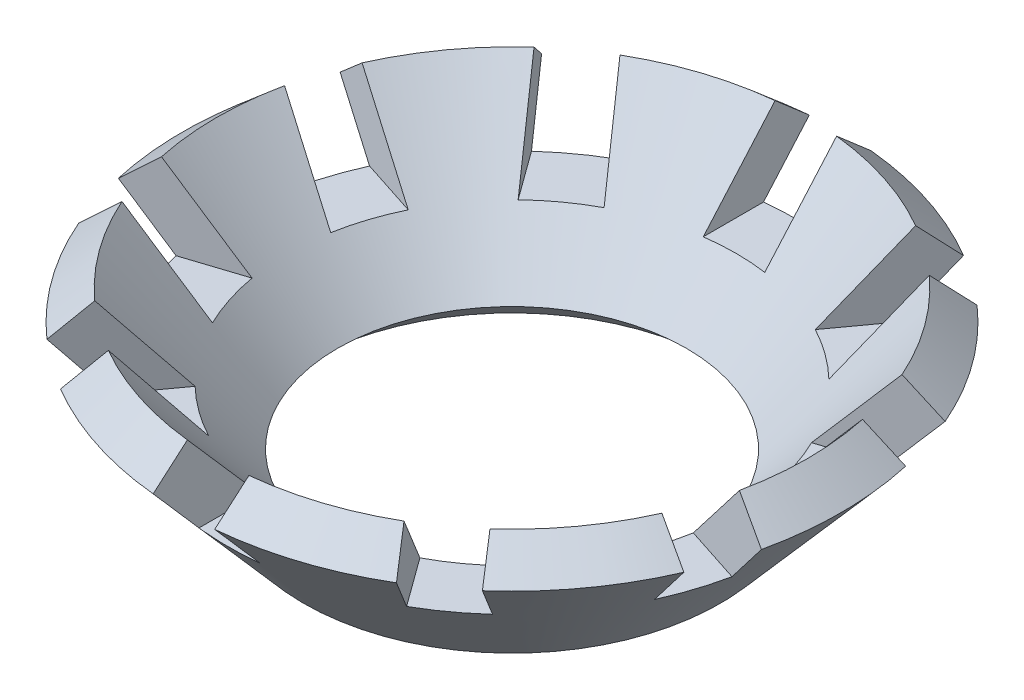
ISO-10303-21;
HEADER;
FILE_DESCRIPTION(('STEP AP214'),'2;1');
FILE_NAME('part.step','',(''),(''),'','','');
FILE_SCHEMA(('AUTOMOTIVE_DESIGN { 1 0 10303 214 1 1 1 1 }'));
ENDSEC;
DATA;
#1=APPLICATION_CONTEXT('core data for automotive mechanical design processes');
#2=APPLICATION_PROTOCOL_DEFINITION('international standard','automotive_design',2000,#1);
#3=PRODUCT_CONTEXT('',#1,'mechanical');
#4=PRODUCT('Part','Part','',(#3));
#5=PRODUCT_RELATED_PRODUCT_CATEGORY('part','',(#4));
#6=PRODUCT_DEFINITION_FORMATION('','',#4);
#7=PRODUCT_DEFINITION_CONTEXT('part definition',#1,'design');
#8=PRODUCT_DEFINITION('design','',#6,#7);
#9=PRODUCT_DEFINITION_SHAPE('','',#8);
#10=(LENGTH_UNIT() NAMED_UNIT(*) SI_UNIT(.MILLI.,.METRE.));
#11=(NAMED_UNIT(*) PLANE_ANGLE_UNIT() SI_UNIT($,.RADIAN.));
#12=(NAMED_UNIT(*) SI_UNIT($,.STERADIAN.) SOLID_ANGLE_UNIT());
#13=UNCERTAINTY_MEASURE_WITH_UNIT(LENGTH_MEASURE(1.E-05),#10,'distance_accuracy_value','');
#14=(GEOMETRIC_REPRESENTATION_CONTEXT(3) GLOBAL_UNCERTAINTY_ASSIGNED_CONTEXT((#13)) GLOBAL_UNIT_ASSIGNED_CONTEXT((#10,
#11,#12)) REPRESENTATION_CONTEXT('',''));
#15=CARTESIAN_POINT('',(0.,0.,0.));
#16=DIRECTION('',(0.,0.,1.));
#17=DIRECTION('',(1.,0.,0.));
#18=AXIS2_PLACEMENT_3D('',#15,#16,#17);
#19=CARTESIAN_POINT('',(0.,-0.366605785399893,0.));
#20=DIRECTION('',(0.,-1.,0.));
#21=DIRECTION('',(0.,0.,-1.));
#22=AXIS2_PLACEMENT_3D('',#19,#20,#21);
#23=CONICAL_SURFACE('',#22,4.08048265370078,0.855211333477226);
#24=CARTESIAN_POINT('',(2.44696736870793,0.000199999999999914,-2.71976573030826));
#25=CARTESIAN_POINT('',(2.48853914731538,-0.0609488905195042,-2.77698437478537));
#26=CARTESIAN_POINT('',(2.53010616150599,-0.122107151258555,-2.8341964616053));
#27=CARTESIAN_POINT('',(2.61323066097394,-0.244442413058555,-2.9486075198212));
#28=CARTESIAN_POINT('',(2.65478814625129,-0.305619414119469,-3.0058064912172));
#29=CARTESIAN_POINT('',(2.69634086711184,-0.366805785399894,-3.06299890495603));
#30=B_SPLINE_CURVE_WITH_KNOTS('',3,(#24,#25,#26,#27,#28,#29),.UNSPECIFIED.,.F.,.F.,(4,2,4),(0.,
0.28048592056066,0.56097184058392),.UNSPECIFIED.);
#31=CARTESIAN_POINT('',(2.44710334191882,0.,-2.71995288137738));
#32=VERTEX_POINT('',#31);
#33=CARTESIAN_POINT('',(2.69620503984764,-0.366605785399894,-3.06281195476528));
#34=VERTEX_POINT('',#33);
#35=EDGE_CURVE('E304',#32,#34,#30,.T.);
#36=ORIENTED_EDGE('',*,*,#35,.F.);
#37=CARTESIAN_POINT('',(0.,0.,0.));
#38=DIRECTION('',(0.,-1.,0.));
#39=DIRECTION('',(0.,0.,-1.));
#40=AXIS2_PLACEMENT_3D('',#37,#38,#39);
#41=CIRCLE('',#40,3.65875094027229);
#42=CARTESIAN_POINT('',(3.34302543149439,0.,-1.48682191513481));
#43=VERTEX_POINT('',#42);
#44=EDGE_CURVE('E571',#32,#43,#41,.T.);
#45=ORIENTED_EDGE('',*,*,#44,.T.);
#46=CARTESIAN_POINT('',(3.7463002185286,-0.366805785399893,-1.61785383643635));
#47=CARTESIAN_POINT('',(3.6790665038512,-0.305619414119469,-1.59600827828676));
#48=CARTESIAN_POINT('',(3.61182508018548,-0.244442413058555,-1.57416021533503));
#49=CARTESIAN_POINT('',(3.47732681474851,-0.122107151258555,-1.5304590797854));
#50=CARTESIAN_POINT('',(3.41006997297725,-0.0609488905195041,-1.50860600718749));
#51=CARTESIAN_POINT('',(3.34280542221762,0.000199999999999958,-1.48675042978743));
#52=B_SPLINE_CURVE_WITH_KNOTS('',3,(#46,#47,#48,#49,#50,#51),.UNSPECIFIED.,.F.,.F.,(4,2,4),(0.,
0.280485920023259,0.560971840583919),.UNSPECIFIED.);
#53=CARTESIAN_POINT('',(3.74608044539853,-0.366605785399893,-1.61778242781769));
#54=VERTEX_POINT('',#53);
#55=EDGE_CURVE('E466',#54,#43,#52,.T.);
#56=ORIENTED_EDGE('',*,*,#55,.F.);
#57=CARTESIAN_POINT('',(0.,-0.366605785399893,0.));
#58=DIRECTION('',(0.,-1.,0.));
#59=DIRECTION('',(0.,0.,-1.));
#60=AXIS2_PLACEMENT_3D('',#57,#58,#59);
#61=CIRCLE('',#60,4.08048265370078);
#62=EDGE_CURVE('E573',#34,#54,#61,.T.);
#63=ORIENTED_EDGE('',*,*,#62,.F.);
#64=EDGE_LOOP('',(#36,#45,#56,#63));
#65=FACE_BOUND('',#64,.T.);
#66=ADVANCED_FACE('F35',(#65),#23,.T.);
#67=CARTESIAN_POINT('',(3.57827637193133,0.000199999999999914,-0.762045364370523));
#68=CARTESIAN_POINT('',(3.64554092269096,-0.060948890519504,-0.783900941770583));
#69=CARTESIAN_POINT('',(3.71279776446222,-0.122107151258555,-0.805754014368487));
#70=CARTESIAN_POINT('',(3.84729602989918,-0.244442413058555,-0.849455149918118));
#71=CARTESIAN_POINT('',(3.91453745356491,-0.305619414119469,-0.871303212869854));
#72=CARTESIAN_POINT('',(3.98177116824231,-0.366805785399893,-0.893148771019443));
#73=B_SPLINE_CURVE_WITH_KNOTS('',3,(#67,#68,#69,#70,#71,#72),.UNSPECIFIED.,.F.,.F.,(4,2,4),(0.,
0.280485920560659,0.560971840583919),.UNSPECIFIED.);
#74=CARTESIAN_POINT('',(3.5784963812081,0.,-0.762116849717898));
#75=VERTEX_POINT('',#74);
#76=CARTESIAN_POINT('',(3.98155139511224,-0.366605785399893,-0.89307736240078));
#77=VERTEX_POINT('',#76);
#78=EDGE_CURVE('E472',#75,#77,#73,.T.);
#79=ORIENTED_EDGE('',*,*,#78,.F.);
#80=CARTESIAN_POINT('',(3.57849638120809,0.,0.762116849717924));
#81=VERTEX_POINT('',#80);
#82=EDGE_CURVE('E583',#75,#81,#41,.T.);
#83=ORIENTED_EDGE('',*,*,#82,.T.);
#84=CARTESIAN_POINT('',(3.9817711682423,-0.366805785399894,0.893148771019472));
#85=CARTESIAN_POINT('',(3.91453745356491,-0.305619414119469,0.871303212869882));
#86=CARTESIAN_POINT('',(3.84729602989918,-0.244442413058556,0.849455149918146));
#87=CARTESIAN_POINT('',(3.71279776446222,-0.122107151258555,0.805754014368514));
#88=CARTESIAN_POINT('',(3.64554092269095,-0.0609488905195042,0.78390094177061));
#89=CARTESIAN_POINT('',(3.57827637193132,0.00019999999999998,0.762045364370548));
#90=B_SPLINE_CURVE_WITH_KNOTS('',3,(#84,#85,#86,#87,#88,#89),.UNSPECIFIED.,.F.,.F.,(4,2,4),(0.,
0.28048592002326,0.56097184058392),.UNSPECIFIED.);
#91=CARTESIAN_POINT('',(3.98155139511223,-0.366605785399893,0.893077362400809));
#92=VERTEX_POINT('',#91);
#93=EDGE_CURVE('E452',#92,#81,#90,.T.);
#94=ORIENTED_EDGE('',*,*,#93,.F.);
#95=EDGE_CURVE('E637',#77,#92,#61,.T.);
#96=ORIENTED_EDGE('',*,*,#95,.F.);
#97=EDGE_LOOP('',(#79,#83,#94,#96));
#98=FACE_BOUND('',#97,.T.);
#99=ADVANCED_FACE('F559',(#98),#23,.T.);
#100=CARTESIAN_POINT('',(3.34280542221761,0.000199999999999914,1.48675042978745));
#101=CARTESIAN_POINT('',(3.41006997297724,-0.0609488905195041,1.50860600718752));
#102=CARTESIAN_POINT('',(3.4773268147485,-0.122107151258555,1.53045907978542));
#103=CARTESIAN_POINT('',(3.61182508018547,-0.244442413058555,1.57416021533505));
#104=CARTESIAN_POINT('',(3.67906650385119,-0.305619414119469,1.59600827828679));
#105=CARTESIAN_POINT('',(3.74630021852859,-0.366805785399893,1.61785383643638));
#106=B_SPLINE_CURVE_WITH_KNOTS('',3,(#100,#101,#102,#103,#104,#105),.UNSPECIFIED.,.F.,.F.,(4,2,
4),(0.,0.28048592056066,0.560971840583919),.UNSPECIFIED.);
#107=CARTESIAN_POINT('',(3.34302543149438,0.,1.48682191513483));
#108=VERTEX_POINT('',#107);
#109=CARTESIAN_POINT('',(3.74608044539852,-0.366605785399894,1.61778242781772));
#110=VERTEX_POINT('',#109);
#111=EDGE_CURVE('E459',#108,#110,#106,.T.);
#112=ORIENTED_EDGE('',*,*,#111,.F.);
#113=CARTESIAN_POINT('',(2.4471033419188,0.,2.7199528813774));
#114=VERTEX_POINT('',#113);
#115=EDGE_CURVE('E589',#108,#114,#41,.T.);
#116=ORIENTED_EDGE('',*,*,#115,.T.);
#117=CARTESIAN_POINT('',(2.69634086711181,-0.366805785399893,3.06299890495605));
#118=CARTESIAN_POINT('',(2.65478814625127,-0.305619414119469,3.00580649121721));
#119=CARTESIAN_POINT('',(2.61323066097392,-0.244442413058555,2.94860751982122));
#120=CARTESIAN_POINT('',(2.53010616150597,-0.122107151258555,2.83419646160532));
#121=CARTESIAN_POINT('',(2.48853914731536,-0.0609488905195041,2.77698437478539));
#122=CARTESIAN_POINT('',(2.44696736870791,0.000199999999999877,2.71976573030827));
#123=B_SPLINE_CURVE_WITH_KNOTS('',3,(#117,#118,#119,#120,#121,#122),.UNSPECIFIED.,.F.,.F.,(4,2,
4),(0.,0.280485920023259,0.560971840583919),.UNSPECIFIED.);
#124=CARTESIAN_POINT('',(2.69620503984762,-0.366605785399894,3.0628119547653));
#125=VERTEX_POINT('',#124);
#126=EDGE_CURVE('E446',#125,#114,#123,.T.);
#127=ORIENTED_EDGE('',*,*,#126,.F.);
#128=EDGE_CURVE('E632',#110,#125,#61,.T.);
#129=ORIENTED_EDGE('',*,*,#128,.F.);
#130=EDGE_LOOP('',(#112,#116,#127,#129));
#131=FACE_BOUND('',#130,.T.);
#132=ADVANCED_FACE('F564',(#131),#23,.T.);
#133=CARTESIAN_POINT('',(2.07986991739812,-0.366805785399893,-3.5108912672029));
#134=CARTESIAN_POINT('',(2.03831719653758,-0.305619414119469,-3.45369885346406));
#135=CARTESIAN_POINT('',(1.99675971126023,-0.244442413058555,-3.39649988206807));
#136=CARTESIAN_POINT('',(1.91363521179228,-0.122107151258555,-3.28208882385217));
#137=CARTESIAN_POINT('',(1.87206819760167,-0.0609488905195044,-3.22487673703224));
#138=CARTESIAN_POINT('',(1.83049641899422,0.000199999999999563,-3.16765809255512));
#139=B_SPLINE_CURVE_WITH_KNOTS('',3,(#133,#134,#135,#136,#137,#138),.UNSPECIFIED.,.F.,.F.,(4,2,
4),(0.,0.280485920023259,0.560971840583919),.UNSPECIFIED.);
#140=CARTESIAN_POINT('',(2.07973409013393,-0.366605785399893,-3.51070431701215));
#141=VERTEX_POINT('',#140);
#142=CARTESIAN_POINT('',(1.83063239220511,0.,-3.16784524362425));
#143=VERTEX_POINT('',#142);
#144=EDGE_CURVE('E478',#141,#143,#139,.T.);
#145=ORIENTED_EDGE('',*,*,#144,.F.);
#146=CARTESIAN_POINT('',(0.381,-0.366605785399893,-4.06265648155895));
#147=VERTEX_POINT('',#146);
#148=EDGE_CURVE('E594',#147,#141,#61,.T.);
#149=ORIENTED_EDGE('',*,*,#148,.F.);
#150=CARTESIAN_POINT('',(0.381,2.66979828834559,-0.447207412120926));
#151=CARTESIAN_POINT('',(0.381,2.65434143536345,-0.470544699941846));
#152=CARTESIAN_POINT('',(0.381,2.63855483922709,-0.49365796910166));
#153=CARTESIAN_POINT('',(0.381,2.60647377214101,-0.539523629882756));
#154=CARTESIAN_POINT('',(0.381,2.59017939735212,-0.562276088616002));
#155=CARTESIAN_POINT('',(0.381,2.54076881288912,-0.630114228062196));
#156=CARTESIAN_POINT('',(0.381,2.50711000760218,-0.674802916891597));
#157=CARTESIAN_POINT('',(0.381,2.43897088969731,-0.7635016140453));
#158=CARTESIAN_POINT('',(0.381,2.40449107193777,-0.807512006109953));
#159=CARTESIAN_POINT('',(0.381,2.33498456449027,-0.895109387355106));
#160=CARTESIAN_POINT('',(0.381,2.29995778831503,-0.938696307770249));
#161=CARTESIAN_POINT('',(0.381,2.19448946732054,-1.06884452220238));
#162=CARTESIAN_POINT('',(0.381,2.12351755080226,-1.15497496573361));
#163=CARTESIAN_POINT('',(0.381,1.98085131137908,-1.32663609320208));
#164=CARTESIAN_POINT('',(0.381,1.90915696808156,-1.41216676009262));
#165=CARTESIAN_POINT('',(0.381,1.6934556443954,-1.66823223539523));
#166=CARTESIAN_POINT('',(0.381,1.54882782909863,-1.83824359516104));
#167=CARTESIAN_POINT('',(0.381,1.25880652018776,-2.17779292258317));
#168=CARTESIAN_POINT('',(0.381,1.11341260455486,-2.34733052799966));
#169=CARTESIAN_POINT('',(0.381,0.822257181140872,-2.6860858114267));
#170=CARTESIAN_POINT('',(0.381,0.676495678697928,-2.85530349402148));
#171=CARTESIAN_POINT('',(0.381,0.434834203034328,-3.13549766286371));
#172=CARTESIAN_POINT('',(0.381,0.338994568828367,-3.24652626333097));
#173=CARTESIAN_POINT('',(0.381,0.147266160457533,-3.46850025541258));
#174=CARTESIAN_POINT('',(0.381,0.0513774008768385,-3.57944565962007));
#175=CARTESIAN_POINT('',(0.381,-0.27494477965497,-3.95683325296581));
#176=CARTESIAN_POINT('',(0.381,-0.505499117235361,-4.22317086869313));
#177=CARTESIAN_POINT('',(0.381,-0.966769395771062,-4.75570631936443));
#178=CARTESIAN_POINT('',(0.381,-1.19748533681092,-5.02190415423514));
#179=CARTESIAN_POINT('',(0.381,-1.65917227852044,-5.55439167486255));
#180=CARTESIAN_POINT('',(0.381,-1.89014334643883,-5.82068130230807));
#181=CARTESIAN_POINT('',(0.381,-2.35215398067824,-6.35320077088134));
#182=CARTESIAN_POINT('',(0.381,-2.5831935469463,-6.61943061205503));
#183=CARTESIAN_POINT('',(0.381,-2.81425165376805,-6.88564434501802));
#184=B_SPLINE_CURVE_WITH_KNOTS('',3,(#150,#151,#152,#153,#154,#155,#156,#157,#158,#159,#160,
#161,#162,#163,#164,#165,#166,#167,#168,#169,#170,#171,#172,#173,#174,#175,#176,#177,#178,#179,
#180,#181,#182,#183),.UNSPECIFIED.,.F.,.F.,(4,2,2,2,2,2,2,2,2,2,2,2,2,2,2,2,4),(0.,
0.0839658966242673,0.167915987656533,0.335735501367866,0.50345630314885,0.671203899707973,
1.00600669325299,1.34081896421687,2.01043153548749,2.68046257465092,3.35048393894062,
3.79049902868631,4.23042152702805,5.28721808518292,6.34401519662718,7.40152177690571,
8.45902754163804),.UNSPECIFIED.);
#185=CARTESIAN_POINT('',(0.381,0.,-3.63885936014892));
#186=VERTEX_POINT('',#185);
#187=EDGE_CURVE('E377',#186,#147,#184,.T.);
#188=ORIENTED_EDGE('',*,*,#187,.F.);
#189=EDGE_CURVE('E582',#186,#143,#41,.T.);
#190=ORIENTED_EDGE('',*,*,#189,.T.);
#191=EDGE_LOOP('',(#145,#149,#188,#190));
#192=FACE_BOUND('',#191,.T.);
#193=ADVANCED_FACE('F973',(#192),#23,.T.);
#194=CARTESIAN_POINT('',(-0.381,2.66098496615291,0.4604455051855));
#195=CARTESIAN_POINT('',(-0.381,2.64513438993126,0.484091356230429));
#196=CARTESIAN_POINT('',(-0.381,2.62896456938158,0.507517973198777));
#197=CARTESIAN_POINT('',(-0.381,2.596132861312,0.554018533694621));
#198=CARTESIAN_POINT('',(-0.381,2.57947105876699,0.577092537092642));
#199=CARTESIAN_POINT('',(-0.381,2.52897365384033,0.645906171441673));
#200=CARTESIAN_POINT('',(-0.381,2.49461188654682,0.69125802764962));
#201=CARTESIAN_POINT('',(-0.381,2.42508954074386,0.78130053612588));
#202=CARTESIAN_POINT('',(-0.381,2.38992940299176,0.825991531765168));
#203=CARTESIAN_POINT('',(-0.381,2.31907732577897,0.914959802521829));
#204=CARTESIAN_POINT('',(-0.381,2.28338530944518,0.959237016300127));
#205=CARTESIAN_POINT('',(-0.381,2.17592502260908,1.09147911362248));
#206=CARTESIAN_POINT('',(-0.381,2.10363988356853,1.17902300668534));
#207=CARTESIAN_POINT('',(-0.381,1.95836448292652,1.35352435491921));
#208=CARTESIAN_POINT('',(-0.381,1.88537420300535,1.44048179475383));
#209=CARTESIAN_POINT('',(-0.381,1.66579898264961,1.70083922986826));
#210=CARTESIAN_POINT('',(-0.381,1.51860735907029,1.87372712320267));
#211=CARTESIAN_POINT('',(-0.381,1.22347841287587,2.21903472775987));
#212=CARTESIAN_POINT('',(-0.381,1.07554070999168,2.39145411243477));
#213=CARTESIAN_POINT('',(-0.381,0.779305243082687,2.7359794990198));
#214=CARTESIAN_POINT('',(-0.381,0.63100748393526,2.90808550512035));
#215=CARTESIAN_POINT('',(-0.381,0.382726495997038,3.1958742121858));
#216=CARTESIAN_POINT('',(-0.381,0.282800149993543,3.31160605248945));
#217=CARTESIAN_POINT('',(-0.381,0.0828962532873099,3.54298591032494));
#218=CARTESIAN_POINT('',(-0.381,-0.017081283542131,3.65863393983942));
#219=CARTESIAN_POINT('',(-0.381,-0.352713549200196,4.04669847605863));
#220=CARTESIAN_POINT('',(-0.381,-0.588485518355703,4.31901356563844));
#221=CARTESIAN_POINT('',(-0.381,-1.06018745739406,4.86350705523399));
#222=CARTESIAN_POINT('',(-0.381,-1.29611742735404,5.1356854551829));
#223=CARTESIAN_POINT('',(-0.381,-1.76822055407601,5.68012488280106));
#224=CARTESIAN_POINT('',(-0.381,-2.00439377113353,5.95238585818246));
#225=CARTESIAN_POINT('',(-0.381,-2.47680718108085,6.49684935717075));
#226=CARTESIAN_POINT('',(-0.381,-2.71304737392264,6.7690518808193));
#227=CARTESIAN_POINT('',(-0.381,-2.94930569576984,7.04123865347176));
#228=B_SPLINE_CURVE_WITH_KNOTS('',3,(#194,#195,#196,#197,#198,#199,#200,#201,#202,#203,#204,
#205,#206,#207,#208,#209,#210,#211,#212,#213,#214,#215,#216,#217,#218,#219,#220,#221,#222,#223,
#224,#225,#226,#227),.UNSPECIFIED.,.F.,.F.,(4,2,2,2,2,2,2,2,2,2,2,2,2,2,2,2,4),(0.,
0.0853919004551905,0.170769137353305,0.341448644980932,0.512036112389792,0.682648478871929,
1.02322986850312,1.36382013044,2.04498981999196,2.7265513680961,3.40810373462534,
3.86681084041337,4.32542804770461,5.40602746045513,6.48662740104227,7.56789259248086,
8.64915701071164),.UNSPECIFIED.);
#229=CARTESIAN_POINT('',(-0.381,0.,3.63885936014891));
#230=VERTEX_POINT('',#229);
#231=CARTESIAN_POINT('',(-0.381,-0.366605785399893,4.06265648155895));
#232=VERTEX_POINT('',#231);
#233=EDGE_CURVE('E425',#230,#232,#228,.T.);
#234=ORIENTED_EDGE('',*,*,#233,.F.);
#235=CARTESIAN_POINT('',(-1.83063239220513,0.,3.16784524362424));
#236=VERTEX_POINT('',#235);
#237=EDGE_CURVE('E958',#230,#236,#41,.T.);
#238=ORIENTED_EDGE('',*,*,#237,.T.);
#239=CARTESIAN_POINT('',(-2.07986991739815,-0.366805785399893,3.51089126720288));
#240=CARTESIAN_POINT('',(-2.03831719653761,-0.305619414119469,3.45369885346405));
#241=CARTESIAN_POINT('',(-1.99675971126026,-0.244442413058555,3.39649988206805));
#242=CARTESIAN_POINT('',(-1.91363521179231,-0.122107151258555,3.28208882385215));
#243=CARTESIAN_POINT('',(-1.87206819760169,-0.0609488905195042,3.22487673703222));
#244=CARTESIAN_POINT('',(-1.83049641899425,0.000199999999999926,3.16765809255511));
#245=B_SPLINE_CURVE_WITH_KNOTS('',3,(#239,#240,#241,#242,#243,#244),.UNSPECIFIED.,.F.,.F.,(4,2,
4),(0.,0.280485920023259,0.560971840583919),.UNSPECIFIED.);
#246=CARTESIAN_POINT('',(-2.07973409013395,-0.366605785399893,3.51070431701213));
#247=VERTEX_POINT('',#246);
#248=EDGE_CURVE('E404',#247,#236,#245,.T.);
#249=ORIENTED_EDGE('',*,*,#248,.F.);
#250=EDGE_CURVE('E622',#232,#247,#61,.T.);
#251=ORIENTED_EDGE('',*,*,#250,.F.);
#252=EDGE_LOOP('',(#234,#238,#249,#251));
#253=FACE_BOUND('',#252,.T.);
#254=ADVANCED_FACE('F982',(#253),#23,.T.);
#255=CARTESIAN_POINT('',(-2.44696736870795,0.000200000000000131,2.71976573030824));
#256=CARTESIAN_POINT('',(-2.4885391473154,-0.0609488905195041,2.77698437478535));
#257=CARTESIAN_POINT('',(-2.53010616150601,-0.122107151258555,2.83419646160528));
#258=CARTESIAN_POINT('',(-2.61323066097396,-0.244442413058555,2.94860751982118));
#259=CARTESIAN_POINT('',(-2.65478814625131,-0.305619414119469,3.00580649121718));
#260=CARTESIAN_POINT('',(-2.69634086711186,-0.366805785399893,3.06299890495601));
#261=B_SPLINE_CURVE_WITH_KNOTS('',3,(#255,#256,#257,#258,#259,#260),.UNSPECIFIED.,.F.,.F.,(4,2,
4),(0.,0.28048592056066,0.560971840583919),.UNSPECIFIED.);
#262=CARTESIAN_POINT('',(-2.44710334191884,0.,2.71995288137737));
#263=VERTEX_POINT('',#262);
#264=CARTESIAN_POINT('',(-2.69620503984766,-0.366605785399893,3.06281195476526));
#265=VERTEX_POINT('',#264);
#266=EDGE_CURVE('E411',#263,#265,#261,.T.);
#267=ORIENTED_EDGE('',*,*,#266,.F.);
#268=CARTESIAN_POINT('',(-3.3430254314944,0.,1.48682191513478));
#269=VERTEX_POINT('',#268);
#270=EDGE_CURVE('E956',#263,#269,#41,.T.);
#271=ORIENTED_EDGE('',*,*,#270,.T.);
#272=CARTESIAN_POINT('',(-3.74630021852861,-0.366805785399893,1.61785383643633));
#273=CARTESIAN_POINT('',(-3.67906650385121,-0.305619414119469,1.59600827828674));
#274=CARTESIAN_POINT('',(-3.61182508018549,-0.244442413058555,1.574160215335));
#275=CARTESIAN_POINT('',(-3.47732681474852,-0.122107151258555,1.53045907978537));
#276=CARTESIAN_POINT('',(-3.41006997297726,-0.0609488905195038,1.50860600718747));
#277=CARTESIAN_POINT('',(-3.34280542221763,0.000200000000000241,1.48675042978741));
#278=B_SPLINE_CURVE_WITH_KNOTS('',3,(#272,#273,#274,#275,#276,#277),.UNSPECIFIED.,.F.,.F.,(4,2,
4),(0.,0.28048592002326,0.56097184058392),.UNSPECIFIED.);
#279=CARTESIAN_POINT('',(-3.74608044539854,-0.366605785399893,1.61778242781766));
#280=VERTEX_POINT('',#279);
#281=EDGE_CURVE('E390',#280,#269,#278,.T.);
#282=ORIENTED_EDGE('',*,*,#281,.F.);
#283=EDGE_CURVE('E618',#265,#280,#61,.T.);
#284=ORIENTED_EDGE('',*,*,#283,.F.);
#285=EDGE_LOOP('',(#267,#271,#282,#284));
#286=FACE_BOUND('',#285,.T.);
#287=ADVANCED_FACE('F1009',(#286),#23,.T.);
#288=CARTESIAN_POINT('',(-3.57827637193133,0.000199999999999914,0.762045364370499));
#289=CARTESIAN_POINT('',(-3.64554092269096,-0.0609488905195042,0.783900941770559));
#290=CARTESIAN_POINT('',(-3.71279776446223,-0.122107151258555,0.805754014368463));
#291=CARTESIAN_POINT('',(-3.84729602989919,-0.244442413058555,0.849455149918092));
#292=CARTESIAN_POINT('',(-3.91453745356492,-0.305619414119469,0.871303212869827));
#293=CARTESIAN_POINT('',(-3.98177116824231,-0.366805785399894,0.893148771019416));
#294=B_SPLINE_CURVE_WITH_KNOTS('',3,(#288,#289,#290,#291,#292,#293),.UNSPECIFIED.,.F.,.F.,(4,2,
4),(0.,0.28048592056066,0.56097184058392),.UNSPECIFIED.);
#295=CARTESIAN_POINT('',(-3.5784963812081,0.,0.762116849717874));
#296=VERTEX_POINT('',#295);
#297=CARTESIAN_POINT('',(-3.98155139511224,-0.366605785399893,0.893077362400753));
#298=VERTEX_POINT('',#297);
#299=EDGE_CURVE('E397',#296,#298,#294,.T.);
#300=ORIENTED_EDGE('',*,*,#299,.F.);
#301=CARTESIAN_POINT('',(-3.57849638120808,0.,-0.762116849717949));
#302=VERTEX_POINT('',#301);
#303=EDGE_CURVE('E954',#296,#302,#41,.T.);
#304=ORIENTED_EDGE('',*,*,#303,.T.);
#305=CARTESIAN_POINT('',(-3.98177116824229,-0.366805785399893,-0.893148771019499));
#306=CARTESIAN_POINT('',(-3.9145374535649,-0.305619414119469,-0.871303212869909));
#307=CARTESIAN_POINT('',(-3.84729602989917,-0.244442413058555,-0.849455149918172));
#308=CARTESIAN_POINT('',(-3.71279776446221,-0.122107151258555,-0.80575401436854));
#309=CARTESIAN_POINT('',(-3.64554092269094,-0.0609488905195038,-0.783900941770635));
#310=CARTESIAN_POINT('',(-3.57827637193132,0.000200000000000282,-0.762045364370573));
#311=B_SPLINE_CURVE_WITH_KNOTS('',3,(#305,#306,#307,#308,#309,#310),.UNSPECIFIED.,.F.,.F.,(4,2,
4),(0.,0.280485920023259,0.560971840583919),.UNSPECIFIED.);
#312=CARTESIAN_POINT('',(-3.98155139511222,-0.366605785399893,-0.893077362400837));
#313=VERTEX_POINT('',#312);
#314=EDGE_CURVE('E351',#313,#302,#311,.T.);
#315=ORIENTED_EDGE('',*,*,#314,.F.);
#316=EDGE_CURVE('E616',#298,#313,#61,.T.);
#317=ORIENTED_EDGE('',*,*,#316,.F.);
#318=EDGE_LOOP('',(#300,#304,#315,#317));
#319=FACE_BOUND('',#318,.T.);
#320=ADVANCED_FACE('F955',(#319),#23,.T.);
#321=CARTESIAN_POINT('',(-3.3428054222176,0.000199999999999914,-1.48675042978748));
#322=CARTESIAN_POINT('',(-3.41006997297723,-0.0609488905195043,-1.50860600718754));
#323=CARTESIAN_POINT('',(-3.47732681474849,-0.122107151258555,-1.53045907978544));
#324=CARTESIAN_POINT('',(-3.61182508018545,-0.244442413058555,-1.57416021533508));
#325=CARTESIAN_POINT('',(-3.67906650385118,-0.305619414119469,-1.59600827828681));
#326=CARTESIAN_POINT('',(-3.74630021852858,-0.366805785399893,-1.6178538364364));
#327=B_SPLINE_CURVE_WITH_KNOTS('',3,(#321,#322,#323,#324,#325,#326),.UNSPECIFIED.,.F.,.F.,(4,2,
4),(0.,0.28048592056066,0.560971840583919),.UNSPECIFIED.);
#328=CARTESIAN_POINT('',(-3.34302543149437,0.,-1.48682191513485));
#329=VERTEX_POINT('',#328);
#330=CARTESIAN_POINT('',(-3.74608044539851,-0.366605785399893,-1.61778242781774));
#331=VERTEX_POINT('',#330);
#332=EDGE_CURVE('E384',#329,#331,#327,.T.);
#333=ORIENTED_EDGE('',*,*,#332,.F.);
#334=CARTESIAN_POINT('',(-2.44710334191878,0.,-2.71995288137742));
#335=VERTEX_POINT('',#334);
#336=EDGE_CURVE('E710',#329,#335,#41,.T.);
#337=ORIENTED_EDGE('',*,*,#336,.T.);
#338=CARTESIAN_POINT('',(-2.69634086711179,-0.366805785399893,-3.06299890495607));
#339=CARTESIAN_POINT('',(-2.65478814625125,-0.305619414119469,-3.00580649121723));
#340=CARTESIAN_POINT('',(-2.6132306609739,-0.244442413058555,-2.94860751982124));
#341=CARTESIAN_POINT('',(-2.53010616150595,-0.122107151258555,-2.83419646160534));
#342=CARTESIAN_POINT('',(-2.48853914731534,-0.060948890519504,-2.77698437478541));
#343=CARTESIAN_POINT('',(-2.44696736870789,0.000200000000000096,-2.71976573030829));
#344=B_SPLINE_CURVE_WITH_KNOTS('',3,(#338,#339,#340,#341,#342,#343),.UNSPECIFIED.,.F.,.F.,(4,2,
4),(0.,0.280485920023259,0.560971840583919),.UNSPECIFIED.);
#345=CARTESIAN_POINT('',(-2.69620503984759,-0.366605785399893,-3.06281195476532));
#346=VERTEX_POINT('',#345);
#347=EDGE_CURVE('E345',#346,#335,#344,.T.);
#348=ORIENTED_EDGE('',*,*,#347,.F.);
#349=EDGE_CURVE('E316',#331,#346,#61,.T.);
#350=ORIENTED_EDGE('',*,*,#349,.F.);
#351=EDGE_LOOP('',(#333,#337,#348,#350));
#352=FACE_BOUND('',#351,.T.);
#353=ADVANCED_FACE('F1015',(#352),#23,.T.);
#354=CARTESIAN_POINT('',(-1.8304964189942,0.000199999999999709,-3.16765809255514));
#355=CARTESIAN_POINT('',(-1.87206819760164,-0.0609488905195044,-3.22487673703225));
#356=CARTESIAN_POINT('',(-1.91363521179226,-0.122107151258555,-3.28208882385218));
#357=CARTESIAN_POINT('',(-1.99675971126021,-0.244442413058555,-3.39649988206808));
#358=CARTESIAN_POINT('',(-2.03831719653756,-0.305619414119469,-3.45369885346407));
#359=CARTESIAN_POINT('',(-2.0798699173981,-0.366805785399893,-3.51089126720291));
#360=B_SPLINE_CURVE_WITH_KNOTS('',3,(#354,#355,#356,#357,#358,#359),.UNSPECIFIED.,.F.,.F.,(4,2,
4),(0.,0.280485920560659,0.560971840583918),.UNSPECIFIED.);
#361=CARTESIAN_POINT('',(-1.83063239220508,0.,-3.16784524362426));
#362=VERTEX_POINT('',#361);
#363=CARTESIAN_POINT('',(-2.0797340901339,-0.366605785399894,-3.51070431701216));
#364=VERTEX_POINT('',#363);
#365=EDGE_CURVE('E432',#362,#364,#360,.T.);
#366=ORIENTED_EDGE('',*,*,#365,.F.);
#367=CARTESIAN_POINT('',(-0.381,0.,-3.63885936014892));
#368=VERTEX_POINT('',#367);
#369=EDGE_CURVE('E587',#362,#368,#41,.T.);
#370=ORIENTED_EDGE('',*,*,#369,.T.);
#371=CARTESIAN_POINT('',(-0.381,-2.81425165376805,-6.88564434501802));
#372=CARTESIAN_POINT('',(-0.381,-2.58325881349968,-6.61950579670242));
#373=CARTESIAN_POINT('',(-0.381,-2.35228449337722,-6.35335115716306));
#374=CARTESIAN_POINT('',(-0.381,-1.8904112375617,-5.82099012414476));
#375=CARTESIAN_POINT('',(-0.381,-1.65951229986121,-5.55478373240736));
#376=CARTESIAN_POINT('',(-0.381,-1.19783206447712,-5.02230415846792));
#377=CARTESIAN_POINT('',(-0.381,-0.9670507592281,-4.75603098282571));
#378=CARTESIAN_POINT('',(-0.381,-0.505643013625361,-4.22333716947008));
#379=CARTESIAN_POINT('',(-0.381,-0.275016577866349,-3.9569165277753));
#380=CARTESIAN_POINT('',(-0.381,0.0707212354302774,-3.5570746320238));
#381=CARTESIAN_POINT('',(-0.381,0.185942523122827,-3.4237484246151));
#382=CARTESIAN_POINT('',(-0.381,0.416278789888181,-3.1570071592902));
#383=CARTESIAN_POINT('',(-0.381,0.531393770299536,-3.02359210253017));
#384=CARTESIAN_POINT('',(-0.381,0.761459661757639,-2.75664169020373));
#385=CARTESIAN_POINT('',(-0.381,0.876410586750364,-2.62310634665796));
#386=CARTESIAN_POINT('',(-0.381,1.10608164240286,-2.35582652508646));
#387=CARTESIAN_POINT('',(-0.381,1.22080176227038,-2.2220820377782));
#388=CARTESIAN_POINT('',(-0.381,1.39259952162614,-2.02118648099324));
#389=CARTESIAN_POINT('',(-0.381,1.44982754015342,-1.95416403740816));
#390=CARTESIAN_POINT('',(-0.381,1.56414554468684,-1.82000329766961));
#391=CARTESIAN_POINT('',(-0.381,1.62123553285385,-1.75286500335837));
#392=CARTESIAN_POINT('',(-0.381,1.73521636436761,-1.61843760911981));
#393=CARTESIAN_POINT('',(-0.381,1.79210723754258,-1.55114853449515));
#394=CARTESIAN_POINT('',(-0.381,1.90561749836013,-1.41633488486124));
#395=CARTESIAN_POINT('',(-0.381,1.96223687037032,-1.34881029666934));
#396=CARTESIAN_POINT('',(-0.381,2.07508582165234,-1.21337321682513));
#397=CARTESIAN_POINT('',(-0.381,2.13131517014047,-1.14546053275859));
#398=CARTESIAN_POINT('',(-0.381,2.24308743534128,-1.00908744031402));
#399=CARTESIAN_POINT('',(-0.381,2.29863046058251,-0.940627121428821));
#400=CARTESIAN_POINT('',(-0.381,2.38103183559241,-0.837167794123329));
#401=CARTESIAN_POINT('',(-0.381,2.40835628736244,-0.802540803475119));
#402=CARTESIAN_POINT('',(-0.381,2.46255398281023,-0.732940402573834));
#403=CARTESIAN_POINT('',(-0.381,2.48942727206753,-0.697967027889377));
#404=CARTESIAN_POINT('',(-0.381,2.54253422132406,-0.627501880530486));
#405=CARTESIAN_POINT('',(-0.381,2.56876749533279,-0.592009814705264));
#406=CARTESIAN_POINT('',(-0.381,2.60734866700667,-0.538209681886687));
#407=CARTESIAN_POINT('',(-0.381,2.62008305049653,-0.520179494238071));
#408=CARTESIAN_POINT('',(-0.381,2.64521442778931,-0.483882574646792));
#409=CARTESIAN_POINT('',(-0.381,2.65761137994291,-0.465615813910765));
#410=CARTESIAN_POINT('',(-0.381,2.66979828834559,-0.447207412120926));
#411=B_SPLINE_CURVE_WITH_KNOTS('',3,(#371,#372,#373,#374,#375,#376,#377,#378,#379,#380,#381,
#382,#383,#384,#385,#386,#387,#388,#389,#390,#391,#392,#393,#394,#395,#396,#397,#398,#399,#400,
#401,#402,#403,#404,#405,#406,#407,#408,#409,#410),.UNSPECIFIED.,.F.,.F.,(4,2,2,2,2,2,2,2,2,2,2,
2,2,2,2,2,2,2,2,4),(0.,1.05720708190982,2.1143832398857,3.17147958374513,4.22860601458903,
4.75725180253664,5.28589084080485,5.8144818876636,6.343097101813,6.60748965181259,
6.87187803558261,7.13622495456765,7.4005869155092,7.66509384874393,7.92955840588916,
8.06188449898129,8.1941971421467,8.32658770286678,8.39280568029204,8.45903179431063),.UNSPECIFIED.);
#412=CARTESIAN_POINT('',(-0.381,-0.366605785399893,-4.06265648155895));
#413=VERTEX_POINT('',#412);
#414=EDGE_CURVE('E370',#413,#368,#411,.T.);
#415=ORIENTED_EDGE('',*,*,#414,.F.);
#416=EDGE_CURVE('E586',#364,#413,#61,.T.);
#417=ORIENTED_EDGE('',*,*,#416,.F.);
#418=EDGE_LOOP('',(#366,#370,#415,#417));
#419=FACE_BOUND('',#418,.T.);
#420=ADVANCED_FACE('F364',(#419),#23,.T.);
#421=CARTESIAN_POINT('',(0.,0.,0.));
#422=DIRECTION('',(0.,1.,0.));
#423=DIRECTION('',(0.,0.,1.));
#424=AXIS2_PLACEMENT_3D('',#421,#422,#423);
#425=CONICAL_SURFACE('',#424,3.65875094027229,0.71558499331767);
#426=CARTESIAN_POINT('',(1.92411934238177,-1.0162,-2.00012715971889));
#427=CARTESIAN_POINT('',(2.01139876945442,-0.846946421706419,-2.12025698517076));
#428=CARTESIAN_POINT('',(2.09862904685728,-0.67761962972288,-2.24031916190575));
#429=CARTESIAN_POINT('',(2.27299129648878,-0.338819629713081,-2.48030820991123));
#430=CARTESIAN_POINT('',(2.360123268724,-0.16934642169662,-2.60023508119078));
#431=CARTESIAN_POINT('',(2.44720609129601,0.000199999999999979,-2.7200943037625));
#432=B_SPLINE_CURVE_WITH_KNOTS('',3,(#426,#427,#428,#429,#430,#431),.UNSPECIFIED.,.F.,.F.,(4,2,
4),(0.,0.675470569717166,1.35094109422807),.UNSPECIFIED.);
#433=CARTESIAN_POINT('',(1.92422250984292,-1.016,-2.0002691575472));
#434=VERTEX_POINT('',#433);
#435=EDGE_CURVE('E519',#434,#32,#432,.T.);
#436=ORIENTED_EDGE('',*,*,#435,.F.);
#437=CARTESIAN_POINT('',(0.,-1.016,0.));
#438=DIRECTION('',(0.,-1.,0.));
#439=DIRECTION('',(0.,0.,-1.));
#440=AXIS2_PLACEMENT_3D('',#437,#438,#439);
#441=CIRCLE('',#440,2.77555561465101);
#442=CARTESIAN_POINT('',(1.30775156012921,-1.016,-2.44816151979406));
#443=VERTEX_POINT('',#442);
#444=EDGE_CURVE('E527',#443,#434,#441,.T.);
#445=ORIENTED_EDGE('',*,*,#444,.F.);
#446=CARTESIAN_POINT('',(1.8307351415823,0.000199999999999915,-3.16798666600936));
#447=CARTESIAN_POINT('',(1.74365231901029,-0.16934642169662,-3.04812744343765));
#448=CARTESIAN_POINT('',(1.65652034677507,-0.338819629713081,-2.92820057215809));
#449=CARTESIAN_POINT('',(1.48215809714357,-0.677619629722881,-2.68821152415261));
#450=CARTESIAN_POINT('',(1.39492781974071,-0.84694642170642,-2.56814934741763));
#451=CARTESIAN_POINT('',(1.30764839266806,-1.0162,-2.44801952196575));
#452=B_SPLINE_CURVE_WITH_KNOTS('',3,(#446,#447,#448,#449,#450,#451),.UNSPECIFIED.,.F.,.F.,(4,2,
4),(0.,0.6754705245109,1.35094109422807),.UNSPECIFIED.);
#453=EDGE_CURVE('E504',#143,#443,#452,.T.);
#454=ORIENTED_EDGE('',*,*,#453,.F.);
#455=ORIENTED_EDGE('',*,*,#189,.F.);
#456=CARTESIAN_POINT('',(0.381,-3.39544675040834,-0.595716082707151));
#457=CARTESIAN_POINT('',(0.381,-3.37064490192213,-0.621294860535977));
#458=CARTESIAN_POINT('',(0.381,-3.34561993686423,-0.646654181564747));
#459=CARTESIAN_POINT('',(0.381,-3.2952235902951,-0.69702306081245));
#460=CARTESIAN_POINT('',(0.381,-3.26985223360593,-0.722032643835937));
#461=CARTESIAN_POINT('',(0.381,-3.19337244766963,-0.796666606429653));
#462=CARTESIAN_POINT('',(0.381,-3.14188895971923,-0.845905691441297));
#463=CARTESIAN_POINT('',(0.381,-3.03833756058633,-0.943736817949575));
#464=CARTESIAN_POINT('',(0.381,-2.98626979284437,-0.992329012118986));
#465=CARTESIAN_POINT('',(0.381,-2.88173906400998,-1.08909241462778));
#466=CARTESIAN_POINT('',(0.381,-2.82927607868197,-1.13726359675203));
#467=CARTESIAN_POINT('',(0.381,-2.68331216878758,-1.27054700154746));
#468=CARTESIAN_POINT('',(0.381,-2.58952662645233,-1.35534709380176));
#469=CARTESIAN_POINT('',(0.381,-2.4014857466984,-1.52442513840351));
#470=CARTESIAN_POINT('',(0.381,-2.30723040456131,-1.60870308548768));
#471=CARTESIAN_POINT('',(0.381,-2.02403521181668,-1.86105249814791));
#472=CARTESIAN_POINT('',(0.381,-1.83466498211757,-2.0286406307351));
#473=CARTESIAN_POINT('',(0.381,-1.45533713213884,-2.36329269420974));
#474=CARTESIAN_POINT('',(0.381,-1.2653793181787,-2.53035640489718));
#475=CARTESIAN_POINT('',(0.381,-0.885171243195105,-2.86414810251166));
#476=CARTESIAN_POINT('',(0.381,-0.694920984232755,-3.03087609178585));
#477=CARTESIAN_POINT('',(0.381,-0.260674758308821,-3.4110302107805));
#478=CARTESIAN_POINT('',(0.381,-0.0166226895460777,-3.62439221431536));
#479=CARTESIAN_POINT('',(0.381,0.471649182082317,-4.05092550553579));
#480=CARTESIAN_POINT('',(0.381,0.715868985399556,-4.2640967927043));
#481=CARTESIAN_POINT('',(0.381,1.20427452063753,-4.69019620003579));
#482=CARTESIAN_POINT('',(0.381,1.44846019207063,-4.90312438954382));
#483=CARTESIAN_POINT('',(0.381,1.93690451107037,-5.32889549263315));
#484=CARTESIAN_POINT('',(0.381,2.18116315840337,-5.54173840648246));
#485=CARTESIAN_POINT('',(0.381,2.42544275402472,-5.75455725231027));
#486=B_SPLINE_CURVE_WITH_KNOTS('',3,(#456,#457,#458,#459,#460,#461,#462,#463,#464,#465,#466,
#467,#468,#469,#470,#471,#472,#473,#474,#475,#476,#477,#478,#479,#480,#481,#482,#483,#484,#485),
.UNSPECIFIED.,.F.,.F.,(4,2,2,2,2,2,2,2,2,2,2,2,2,2,4),(0.,0.10688152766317,0.213755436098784,
0.427463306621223,0.641119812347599,0.854789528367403,1.23410208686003,1.61341846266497,
2.3720463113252,3.13095871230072,3.88986578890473,4.86236902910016,5.83487489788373,
6.80682420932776,7.77877044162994),.UNSPECIFIED.);
#487=CARTESIAN_POINT('',(0.381,-1.016,-2.74928135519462));
#488=VERTEX_POINT('',#487);
#489=EDGE_CURVE('E961',#488,#186,#486,.T.);
#490=ORIENTED_EDGE('',*,*,#489,.F.);
#491=CARTESIAN_POINT('',(0.,-1.016,0.));
#492=DIRECTION('',(0.,-1.,0.));
#493=DIRECTION('',(0.,0.,-1.));
#494=AXIS2_PLACEMENT_3D('',#491,#492,#493);
#495=CIRCLE('',#494,2.77555561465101);
#496=CARTESIAN_POINT('',(-0.381,-1.016,-2.74928135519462));
#497=VERTEX_POINT('',#496);
#498=EDGE_CURVE('E592',#497,#488,#495,.T.);
#499=ORIENTED_EDGE('',*,*,#498,.F.);
#500=CARTESIAN_POINT('',(-0.381,2.42544275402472,-5.75455725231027));
#501=CARTESIAN_POINT('',(-0.381,2.181083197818,-5.54166862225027));
#502=CARTESIAN_POINT('',(-0.381,1.93674451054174,-5.3287560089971));
#503=CARTESIAN_POINT('',(-0.381,1.44814576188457,-4.90285031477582));
#504=CARTESIAN_POINT('',(-0.381,1.203885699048,-4.68985723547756));
#505=CARTESIAN_POINT('',(-0.381,0.715485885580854,-4.26376231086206));
#506=CARTESIAN_POINT('',(-0.381,0.471346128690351,-4.05066047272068));
#507=CARTESIAN_POINT('',(-0.381,-0.0167717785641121,-3.62426227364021));
#508=CARTESIAN_POINT('',(-0.381,-0.260749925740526,-3.41096590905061));
#509=CARTESIAN_POINT('',(-0.381,-0.626514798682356,-3.09076047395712));
#510=CARTESIAN_POINT('',(-0.381,-0.748410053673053,-2.98397539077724));
#511=CARTESIAN_POINT('',(-0.381,-0.992098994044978,-2.77029097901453));
#512=CARTESIAN_POINT('',(-0.381,-1.11389268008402,-2.66339165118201));
#513=CARTESIAN_POINT('',(-0.381,-1.35733098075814,-2.44943708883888));
#514=CARTESIAN_POINT('',(-0.381,-1.47897560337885,-2.34238186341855));
#515=CARTESIAN_POINT('',(-0.381,-1.72205542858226,-2.12802815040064));
#516=CARTESIAN_POINT('',(-0.381,-1.84349062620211,-2.02072965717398));
#517=CARTESIAN_POINT('',(-0.381,-2.08605300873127,-1.80573763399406));
#518=CARTESIAN_POINT('',(-0.381,-2.20718013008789,-1.6980440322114));
#519=CARTESIAN_POINT('',(-0.381,-2.38843142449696,-1.53602109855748));
#520=CARTESIAN_POINT('',(-0.381,-2.44877301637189,-1.48193508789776));
#521=CARTESIAN_POINT('',(-0.381,-2.56925552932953,-1.37353734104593));
#522=CARTESIAN_POINT('',(-0.381,-2.62939644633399,-1.31922560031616));
#523=CARTESIAN_POINT('',(-0.381,-2.74940755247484,-1.21027074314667));
#524=CARTESIAN_POINT('',(-0.381,-2.8092776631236,-1.15562754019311));
#525=CARTESIAN_POINT('',(-0.381,-2.92858812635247,-1.0458789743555));
#526=CARTESIAN_POINT('',(-0.381,-2.98802850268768,-0.990773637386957));
#527=CARTESIAN_POINT('',(-0.381,-3.0766815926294,-0.907557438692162));
#528=CARTESIAN_POINT('',(-0.381,-3.10615225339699,-0.879721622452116));
#529=CARTESIAN_POINT('',(-0.381,-3.1648643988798,-0.823810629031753));
#530=CARTESIAN_POINT('',(-0.381,-3.19410588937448,-0.795735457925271));
#531=CARTESIAN_POINT('',(-0.381,-3.25229322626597,-0.73926796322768));
#532=CARTESIAN_POINT('',(-0.381,-3.28123901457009,-0.710875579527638));
#533=CARTESIAN_POINT('',(-0.381,-3.33869972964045,-0.653653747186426));
#534=CARTESIAN_POINT('',(-0.381,-3.36721461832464,-0.62482426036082));
#535=CARTESIAN_POINT('',(-0.381,-3.39544675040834,-0.595716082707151));
#536=B_SPLINE_CURVE_WITH_KNOTS('',3,(#500,#501,#502,#503,#504,#505,#506,#507,#508,#509,#510,
#511,#512,#513,#514,#515,#516,#517,#518,#519,#520,#521,#522,#523,#524,#525,#526,#527,#528,#529,
#530,#531,#532,#533,#534,#535),.UNSPECIFIED.,.F.,.F.,(4,2,2,2,2,2,2,2,2,2,2,2,2,2,2,2,2,4),(0.,
0.972264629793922,1.94451008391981,2.91669805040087,3.88890465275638,4.37506667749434,
4.8612255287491,5.34735708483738,5.83350000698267,6.3197361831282,6.56283587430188,
6.8059404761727,7.04911152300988,7.29226902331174,7.41388282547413,7.53549355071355,
7.6571277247,7.77877258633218),.UNSPECIFIED.);
#537=EDGE_CURVE('E540',#368,#497,#536,.T.);
#538=ORIENTED_EDGE('',*,*,#537,.F.);
#539=ORIENTED_EDGE('',*,*,#369,.F.);
#540=CARTESIAN_POINT('',(-1.30764839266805,-1.01619999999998,-2.44801952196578));
#541=CARTESIAN_POINT('',(-1.3949278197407,-0.846946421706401,-2.56814934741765));
#542=CARTESIAN_POINT('',(-1.48215809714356,-0.677619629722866,-2.68821152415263));
#543=CARTESIAN_POINT('',(-1.65652034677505,-0.338819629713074,-2.92820057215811));
#544=CARTESIAN_POINT('',(-1.74365231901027,-0.169346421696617,-3.04812744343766));
#545=CARTESIAN_POINT('',(-1.83073514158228,0.000199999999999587,-3.16798666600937));
#546=B_SPLINE_CURVE_WITH_KNOTS('',3,(#540,#541,#542,#543,#544,#545),.UNSPECIFIED.,.F.,.F.,(4,2,
4),(0.,0.675470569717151,1.35094109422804),.UNSPECIFIED.);
#547=CARTESIAN_POINT('',(-1.30775156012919,-1.016,-2.44816151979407));
#548=VERTEX_POINT('',#547);
#549=EDGE_CURVE('E832',#548,#362,#546,.T.);
#550=ORIENTED_EDGE('',*,*,#549,.F.);
#551=CARTESIAN_POINT('',(-1.92422250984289,-1.016,-2.00026915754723));
#552=VERTEX_POINT('',#551);
#553=EDGE_CURVE('E524',#552,#548,#441,.T.);
#554=ORIENTED_EDGE('',*,*,#553,.F.);
#555=CARTESIAN_POINT('',(-2.44720609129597,0.000200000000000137,-2.72009430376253));
#556=CARTESIAN_POINT('',(-2.36012326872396,-0.16934642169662,-2.60023508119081));
#557=CARTESIAN_POINT('',(-2.27299129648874,-0.338819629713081,-2.48030820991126));
#558=CARTESIAN_POINT('',(-2.09862904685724,-0.67761962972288,-2.24031916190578));
#559=CARTESIAN_POINT('',(-2.01139876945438,-0.846946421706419,-2.12025698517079));
#560=CARTESIAN_POINT('',(-1.92411934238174,-1.0162,-2.00012715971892));
#561=B_SPLINE_CURVE_WITH_KNOTS('',3,(#555,#556,#557,#558,#559,#560),.UNSPECIFIED.,.F.,.F.,(4,2,
4),(0.,0.675470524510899,1.35094109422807),.UNSPECIFIED.);
#562=EDGE_CURVE('E307',#335,#552,#561,.T.);
#563=ORIENTED_EDGE('',*,*,#562,.F.);
#564=ORIENTED_EDGE('',*,*,#336,.F.);
#565=CARTESIAN_POINT('',(-2.49681954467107,-1.0162,-1.21187295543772));
#566=CARTESIAN_POINT('',(-2.63804062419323,-0.846946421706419,-1.25775846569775));
#567=CARTESIAN_POINT('',(-2.77918217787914,-0.677619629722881,-1.30361813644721));
#568=CARTESIAN_POINT('',(-3.0613062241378,-0.338819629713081,-1.39528579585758));
#569=CARTESIAN_POINT('',(-3.2022887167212,-0.16934642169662,-1.44109378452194));
#570=CARTESIAN_POINT('',(-3.34319168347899,0.000199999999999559,-1.4868759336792));
#571=B_SPLINE_CURVE_WITH_KNOTS('',3,(#565,#566,#567,#568,#569,#570),.UNSPECIFIED.,.F.,.F.,(4,2,
4),(0.,0.675470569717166,1.35094109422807),.UNSPECIFIED.);
#572=CARTESIAN_POINT('',(-2.49698647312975,-1.016,-1.21192719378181));
#573=VERTEX_POINT('',#572);
#574=EDGE_CURVE('E703',#573,#329,#571,.T.);
#575=ORIENTED_EDGE('',*,*,#574,.F.);
#576=CARTESIAN_POINT('',(-2.73245742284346,-1.016,-0.487222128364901));
#577=VERTEX_POINT('',#576);
#578=EDGE_CURVE('E526',#577,#573,#441,.T.);
#579=ORIENTED_EDGE('',*,*,#578,.F.);
#580=CARTESIAN_POINT('',(-3.57866263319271,0.000199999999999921,-0.762170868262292));
#581=CARTESIAN_POINT('',(-3.43775966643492,-0.16934642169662,-0.716388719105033));
#582=CARTESIAN_POINT('',(-3.29677717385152,-0.338819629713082,-0.670580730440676));
#583=CARTESIAN_POINT('',(-3.01465312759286,-0.677619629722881,-0.578913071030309));
#584=CARTESIAN_POINT('',(-2.87351157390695,-0.84694642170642,-0.53305340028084));
#585=CARTESIAN_POINT('',(-2.73229049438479,-1.0162,-0.487167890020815));
#586=B_SPLINE_CURVE_WITH_KNOTS('',3,(#580,#581,#582,#583,#584,#585),.UNSPECIFIED.,.F.,.F.,(4,2,
4),(0.,0.6754705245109,1.35094109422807),.UNSPECIFIED.);
#587=EDGE_CURVE('E715',#302,#577,#586,.T.);
#588=ORIENTED_EDGE('',*,*,#587,.F.);
#589=ORIENTED_EDGE('',*,*,#303,.F.);
#590=CARTESIAN_POINT('',(-2.7322904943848,-1.0162,0.487167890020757));
#591=CARTESIAN_POINT('',(-2.87351157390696,-0.84694642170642,0.53305340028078));
#592=CARTESIAN_POINT('',(-3.01465312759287,-0.677619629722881,0.578913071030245));
#593=CARTESIAN_POINT('',(-3.29677717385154,-0.338819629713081,0.670580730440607));
#594=CARTESIAN_POINT('',(-3.43775966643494,-0.16934642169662,0.716388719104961));
#595=CARTESIAN_POINT('',(-3.57866263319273,0.000200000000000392,0.762170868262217));
#596=B_SPLINE_CURVE_WITH_KNOTS('',3,(#590,#591,#592,#593,#594,#595),.UNSPECIFIED.,.F.,.F.,(4,2,
4),(0.,0.675470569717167,1.35094109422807),.UNSPECIFIED.);
#597=CARTESIAN_POINT('',(-2.73245742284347,-1.016,0.487222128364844));
#598=VERTEX_POINT('',#597);
#599=EDGE_CURVE('E750',#598,#296,#596,.T.);
#600=ORIENTED_EDGE('',*,*,#599,.F.);
#601=CARTESIAN_POINT('',(-2.49698647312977,-1.016,1.21192719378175));
#602=VERTEX_POINT('',#601);
#603=EDGE_CURVE('E680',#602,#598,#441,.T.);
#604=ORIENTED_EDGE('',*,*,#603,.F.);
#605=CARTESIAN_POINT('',(-3.34319168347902,0.000199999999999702,1.48687593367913));
#606=CARTESIAN_POINT('',(-3.20228871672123,-0.16934642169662,1.44109378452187));
#607=CARTESIAN_POINT('',(-3.06130622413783,-0.338819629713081,1.39528579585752));
#608=CARTESIAN_POINT('',(-2.77918217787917,-0.677619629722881,1.30361813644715));
#609=CARTESIAN_POINT('',(-2.63804062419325,-0.84694642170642,1.25775846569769));
#610=CARTESIAN_POINT('',(-2.49681954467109,-1.0162,1.21187295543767));
#611=B_SPLINE_CURVE_WITH_KNOTS('',3,(#605,#606,#607,#608,#609,#610),.UNSPECIFIED.,.F.,.F.,(4,2,
4),(0.,0.6754705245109,1.35094109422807),.UNSPECIFIED.);
#612=EDGE_CURVE('E713',#269,#602,#611,.T.);
#613=ORIENTED_EDGE('',*,*,#612,.F.);
#614=ORIENTED_EDGE('',*,*,#270,.F.);
#615=CARTESIAN_POINT('',(-1.92411934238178,-1.0162,2.00012715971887));
#616=CARTESIAN_POINT('',(-2.01139876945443,-0.84694642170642,2.12025698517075));
#617=CARTESIAN_POINT('',(-2.09862904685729,-0.677619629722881,2.24031916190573));
#618=CARTESIAN_POINT('',(-2.2729912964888,-0.338819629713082,2.48030820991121));
#619=CARTESIAN_POINT('',(-2.36012326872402,-0.16934642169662,2.60023508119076));
#620=CARTESIAN_POINT('',(-2.44720609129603,0.000199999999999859,2.72009430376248));
#621=B_SPLINE_CURVE_WITH_KNOTS('',3,(#615,#616,#617,#618,#619,#620),.UNSPECIFIED.,.F.,.F.,(4,2,
4),(0.,0.675470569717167,1.35094109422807),.UNSPECIFIED.);
#622=CARTESIAN_POINT('',(-1.92422250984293,-1.016,2.00026915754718));
#623=VERTEX_POINT('',#622);
#624=EDGE_CURVE('E785',#623,#263,#621,.T.);
#625=ORIENTED_EDGE('',*,*,#624,.F.);
#626=CARTESIAN_POINT('',(-1.30775156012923,-1.016,2.44816151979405));
#627=VERTEX_POINT('',#626);
#628=EDGE_CURVE('E674',#627,#623,#441,.T.);
#629=ORIENTED_EDGE('',*,*,#628,.F.);
#630=CARTESIAN_POINT('',(-1.83073514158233,0.000200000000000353,3.16798666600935));
#631=CARTESIAN_POINT('',(-1.74365231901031,-0.16934642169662,3.04812744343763));
#632=CARTESIAN_POINT('',(-1.65652034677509,-0.338819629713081,2.92820057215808));
#633=CARTESIAN_POINT('',(-1.48215809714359,-0.677619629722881,2.6882115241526));
#634=CARTESIAN_POINT('',(-1.39492781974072,-0.84694642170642,2.56814934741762));
#635=CARTESIAN_POINT('',(-1.30764839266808,-1.0162,2.44801952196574));
#636=B_SPLINE_CURVE_WITH_KNOTS('',3,(#630,#631,#632,#633,#634,#635),.UNSPECIFIED.,.F.,.F.,(4,2,
4),(0.,0.6754705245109,1.35094109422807),.UNSPECIFIED.);
#637=EDGE_CURVE('E760',#236,#627,#636,.T.);
#638=ORIENTED_EDGE('',*,*,#637,.F.);
#639=ORIENTED_EDGE('',*,*,#237,.F.);
#640=CARTESIAN_POINT('',(-0.381,-3.46874237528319,0.518485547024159));
#641=CARTESIAN_POINT('',(-0.381,-3.44667741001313,0.542271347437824));
#642=CARTESIAN_POINT('',(-0.381,-3.42434631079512,0.565805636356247));
#643=CARTESIAN_POINT('',(-0.381,-3.37927369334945,0.612473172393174));
#644=CARTESIAN_POINT('',(-0.381,-3.35653222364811,0.635606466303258));
#645=CARTESIAN_POINT('',(-0.381,-3.28788090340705,0.704552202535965));
#646=CARTESIAN_POINT('',(-0.381,-3.24153069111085,0.749924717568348));
#647=CARTESIAN_POINT('',(-0.381,-3.14815623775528,0.839929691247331));
#648=CARTESIAN_POINT('',(-0.381,-3.10113226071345,0.884562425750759));
#649=CARTESIAN_POINT('',(-0.381,-3.00662898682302,0.973351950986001));
#650=CARTESIAN_POINT('',(-0.381,-2.95914964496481,1.01750869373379));
#651=CARTESIAN_POINT('',(-0.381,-2.82847448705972,1.13820357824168));
#652=CARTESIAN_POINT('',(-0.381,-2.74497026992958,1.21440722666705));
#653=CARTESIAN_POINT('',(-0.381,-2.577443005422,1.36624252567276));
#654=CARTESIAN_POINT('',(-0.381,-2.49341995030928,1.44187416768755));
#655=CARTESIAN_POINT('',(-0.381,-2.24087729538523,1.66823592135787));
#656=CARTESIAN_POINT('',(-0.381,-2.07188201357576,1.81843485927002));
#657=CARTESIAN_POINT('',(-0.381,-1.73322113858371,2.11827200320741));
#658=CARTESIAN_POINT('',(-0.381,-1.56355521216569,2.26790983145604));
#659=CARTESIAN_POINT('',(-0.381,-1.22389916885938,2.56681393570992));
#660=CARTESIAN_POINT('',(-0.381,-1.05390905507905,2.71608021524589));
#661=CARTESIAN_POINT('',(-0.381,-0.66501240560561,3.05711790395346));
#662=CARTESIAN_POINT('',(-0.381,-0.446042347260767,3.24881681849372));
#663=CARTESIAN_POINT('',(-0.381,-0.00791471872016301,3.63200183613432));
#664=CARTESIAN_POINT('',(-0.381,0.211242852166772,3.8234879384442));
#665=CARTESIAN_POINT('',(-0.381,0.649481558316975,4.20615501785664));
#666=CARTESIAN_POINT('',(-0.381,0.8685625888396,4.39733611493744));
#667=CARTESIAN_POINT('',(-0.381,1.30680598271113,4.7796031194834));
#668=CARTESIAN_POINT('',(-0.381,1.52596834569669,4.9706890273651));
#669=CARTESIAN_POINT('',(-0.381,1.74515406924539,5.16174810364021));
#670=B_SPLINE_CURVE_WITH_KNOTS('',3,(#640,#641,#642,#643,#644,#645,#646,#647,#648,#649,#650,
#651,#652,#653,#654,#655,#656,#657,#658,#659,#660,#661,#662,#663,#664,#665,#666,#667,#668,#669),
.UNSPECIFIED.,.F.,.F.,(4,2,2,2,2,2,2,2,2,2,2,2,2,2,4),(0.,0.0973256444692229,0.194639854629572,
0.389209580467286,0.58370504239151,0.778219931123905,1.11735990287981,1.45650494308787,
2.13478612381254,2.81346257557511,3.49213255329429,4.36521153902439,5.2382937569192,
6.11060123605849,6.98290486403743),.UNSPECIFIED.);
#671=CARTESIAN_POINT('',(-0.381,-1.016,2.74928135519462));
#672=VERTEX_POINT('',#671);
#673=EDGE_CURVE('E805',#672,#230,#670,.T.);
#674=ORIENTED_EDGE('',*,*,#673,.F.);
#675=CARTESIAN_POINT('',(0.381,-1.016,2.74928135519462));
#676=VERTEX_POINT('',#675);
#677=EDGE_CURVE('E668',#676,#672,#441,.T.);
#678=ORIENTED_EDGE('',*,*,#677,.F.);
#679=CARTESIAN_POINT('',(0.381,1.7451540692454,5.16174810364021));
#680=CARTESIAN_POINT('',(0.381,1.52585694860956,4.97059178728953));
#681=CARTESIAN_POINT('',(0.381,1.30658310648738,4.77940872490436));
#682=CARTESIAN_POINT('',(0.381,0.868124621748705,4.39695407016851));
#683=CARTESIAN_POINT('',(0.381,0.648939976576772,4.2056824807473));
#684=CARTESIAN_POINT('',(0.381,0.210709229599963,3.82302161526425));
#685=CARTESIAN_POINT('',(0.381,-0.00833688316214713,3.63163235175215));
#686=CARTESIAN_POINT('',(0.381,-0.446249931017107,3.24863552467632));
#687=CARTESIAN_POINT('',(0.381,-0.665116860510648,3.05702795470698));
#688=CARTESIAN_POINT('',(0.381,-0.993195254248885,2.7693215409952));
#689=CARTESIAN_POINT('',(0.381,-1.1025280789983,2.67336111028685));
#690=CARTESIAN_POINT('',(0.381,-1.32107981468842,2.48131286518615));
#691=CARTESIAN_POINT('',(0.381,-1.430298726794,2.38522505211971));
#692=CARTESIAN_POINT('',(0.381,-1.64856758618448,2.19287704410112));
#693=CARTESIAN_POINT('',(0.381,-1.75761754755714,2.09661686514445));
#694=CARTESIAN_POINT('',(0.381,-1.97548347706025,1.90382389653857));
#695=CARTESIAN_POINT('',(0.381,-2.0842994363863,1.80729109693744));
#696=CARTESIAN_POINT('',(0.381,-2.30159215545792,1.61377766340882));
#697=CARTESIAN_POINT('',(0.381,-2.41006880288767,1.51679690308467));
#698=CARTESIAN_POINT('',(0.381,-2.57228745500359,1.37078711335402));
#699=CARTESIAN_POINT('',(0.381,-2.62627439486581,1.32203035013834));
#700=CARTESIAN_POINT('',(0.381,-2.73402215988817,1.22426380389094));
#701=CARTESIAN_POINT('',(0.381,-2.78778297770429,1.17525401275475));
#702=CARTESIAN_POINT('',(0.381,-2.89500285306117,1.07685880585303));
#703=CARTESIAN_POINT('',(0.381,-2.94846177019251,1.0274732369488));
#704=CARTESIAN_POINT('',(0.381,-3.05489063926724,0.928185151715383));
#705=CARTESIAN_POINT('',(0.381,-3.10786063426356,0.878282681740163));
#706=CARTESIAN_POINT('',(0.381,-3.18673848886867,0.802801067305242));
#707=CARTESIAN_POINT('',(0.381,-3.21294084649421,0.777530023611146));
#708=CARTESIAN_POINT('',(0.381,-3.26508262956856,0.72671996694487));
#709=CARTESIAN_POINT('',(0.381,-3.29102206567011,0.701180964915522));
#710=CARTESIAN_POINT('',(0.381,-3.34256229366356,0.649745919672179));
#711=CARTESIAN_POINT('',(0.381,-3.3681629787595,0.623849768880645));
#712=CARTESIAN_POINT('',(0.381,-3.41886612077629,0.571568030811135));
#713=CARTESIAN_POINT('',(0.381,-3.44396850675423,0.545182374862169));
#714=CARTESIAN_POINT('',(0.381,-3.46874237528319,0.51848554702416));
#715=B_SPLINE_CURVE_WITH_KNOTS('',3,(#679,#680,#681,#682,#683,#684,#685,#686,#687,#688,#689,
#690,#691,#692,#693,#694,#695,#696,#697,#698,#699,#700,#701,#702,#703,#704,#705,#706,#707,#708,
#709,#710,#711,#712,#713,#714),.UNSPECIFIED.,.F.,.F.,(4,2,2,2,2,2,2,2,2,2,2,2,2,2,2,2,2,4),(0.,
0.872747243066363,1.74546741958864,2.61810671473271,3.49077231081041,3.92718790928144,
4.36359900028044,4.79997149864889,5.23636013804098,5.67288051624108,5.8911145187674,
6.10935555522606,6.32769088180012,6.54600679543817,6.6552147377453,6.76441823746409,
6.87365538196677,6.98290796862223),.UNSPECIFIED.);
#716=CARTESIAN_POINT('',(0.381,0.,3.63885936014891));
#717=VERTEX_POINT('',#716);
#718=EDGE_CURVE('E795',#717,#676,#715,.T.);
#719=ORIENTED_EDGE('',*,*,#718,.F.);
#720=CARTESIAN_POINT('',(1.83063239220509,0.,3.16784524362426));
#721=VERTEX_POINT('',#720);
#722=EDGE_CURVE('E983',#721,#717,#41,.T.);
#723=ORIENTED_EDGE('',*,*,#722,.F.);
#724=CARTESIAN_POINT('',(1.30764839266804,-1.0162,2.44801952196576));
#725=CARTESIAN_POINT('',(1.39492781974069,-0.84694642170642,2.56814934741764));
#726=CARTESIAN_POINT('',(1.48215809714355,-0.677619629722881,2.68821152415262));
#727=CARTESIAN_POINT('',(1.65652034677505,-0.338819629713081,2.9282005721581));
#728=CARTESIAN_POINT('',(1.74365231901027,-0.16934642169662,3.04812744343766));
#729=CARTESIAN_POINT('',(1.83073514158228,0.000200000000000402,3.16798666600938));
#730=B_SPLINE_CURVE_WITH_KNOTS('',3,(#724,#725,#726,#727,#728,#729),.UNSPECIFIED.,.F.,.F.,(4,2,
4),(0.,0.675470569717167,1.35094109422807),.UNSPECIFIED.);
#731=CARTESIAN_POINT('',(1.30775156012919,-1.016,2.44816151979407));
#732=VERTEX_POINT('',#731);
#733=EDGE_CURVE('E844',#732,#721,#730,.T.);
#734=ORIENTED_EDGE('',*,*,#733,.F.);
#735=CARTESIAN_POINT('',(1.92422250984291,-1.016,2.00026915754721));
#736=VERTEX_POINT('',#735);
#737=EDGE_CURVE('E662',#736,#732,#441,.T.);
#738=ORIENTED_EDGE('',*,*,#737,.F.);
#739=CARTESIAN_POINT('',(2.44720609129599,0.000199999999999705,2.72009430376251));
#740=CARTESIAN_POINT('',(2.36012326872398,-0.16934642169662,2.6002350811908));
#741=CARTESIAN_POINT('',(2.27299129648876,-0.338819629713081,2.48030820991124));
#742=CARTESIAN_POINT('',(2.09862904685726,-0.677619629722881,2.24031916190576));
#743=CARTESIAN_POINT('',(2.0113987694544,-0.846946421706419,2.12025698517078));
#744=CARTESIAN_POINT('',(1.92411934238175,-1.0162,2.0001271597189));
#745=B_SPLINE_CURVE_WITH_KNOTS('',3,(#739,#740,#741,#742,#743,#744),.UNSPECIFIED.,.F.,.F.,(4,2,
4),(0.,0.675470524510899,1.35094109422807),.UNSPECIFIED.);
#746=EDGE_CURVE('E843',#114,#736,#745,.T.);
#747=ORIENTED_EDGE('',*,*,#746,.F.);
#748=ORIENTED_EDGE('',*,*,#115,.F.);
#749=CARTESIAN_POINT('',(2.49681954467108,-1.0162,1.2118729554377));
#750=CARTESIAN_POINT('',(2.63804062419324,-0.84694642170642,1.25775846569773));
#751=CARTESIAN_POINT('',(2.77918217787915,-0.677619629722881,1.30361813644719));
#752=CARTESIAN_POINT('',(3.06130622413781,-0.338819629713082,1.39528579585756));
#753=CARTESIAN_POINT('',(3.20228871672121,-0.169346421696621,1.44109378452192));
#754=CARTESIAN_POINT('',(3.343191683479,0.000199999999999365,1.48687593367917));
#755=B_SPLINE_CURVE_WITH_KNOTS('',3,(#749,#750,#751,#752,#753,#754),.UNSPECIFIED.,.F.,.F.,(4,2,
4),(0.,0.675470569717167,1.35094109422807),.UNSPECIFIED.);
#756=CARTESIAN_POINT('',(2.49698647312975,-1.016,1.21192719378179));
#757=VERTEX_POINT('',#756);
#758=EDGE_CURVE('E883',#757,#108,#755,.T.);
#759=ORIENTED_EDGE('',*,*,#758,.F.);
#760=CARTESIAN_POINT('',(2.73245742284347,-1.016,0.487222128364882));
#761=VERTEX_POINT('',#760);
#762=EDGE_CURVE('E657',#761,#757,#441,.T.);
#763=ORIENTED_EDGE('',*,*,#762,.F.);
#764=CARTESIAN_POINT('',(3.57866263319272,0.000200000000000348,0.762170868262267));
#765=CARTESIAN_POINT('',(3.43775966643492,-0.16934642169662,0.716388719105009));
#766=CARTESIAN_POINT('',(3.29677717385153,-0.338819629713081,0.670580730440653));
#767=CARTESIAN_POINT('',(3.01465312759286,-0.677619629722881,0.578913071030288));
#768=CARTESIAN_POINT('',(2.87351157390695,-0.846946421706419,0.53305340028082));
#769=CARTESIAN_POINT('',(2.73229049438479,-1.0162,0.487167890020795));
#770=B_SPLINE_CURVE_WITH_KNOTS('',3,(#764,#765,#766,#767,#768,#769),.UNSPECIFIED.,.F.,.F.,(4,2,
4),(0.,0.6754705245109,1.35094109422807),.UNSPECIFIED.);
#771=EDGE_CURVE('E857',#81,#761,#770,.T.);
#772=ORIENTED_EDGE('',*,*,#771,.F.);
#773=ORIENTED_EDGE('',*,*,#82,.F.);
#774=CARTESIAN_POINT('',(2.73229049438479,-1.0162,-0.487167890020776));
#775=CARTESIAN_POINT('',(2.87351157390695,-0.84694642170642,-0.533053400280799));
#776=CARTESIAN_POINT('',(3.01465312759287,-0.677619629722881,-0.578913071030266));
#777=CARTESIAN_POINT('',(3.29677717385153,-0.338819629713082,-0.670580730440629));
#778=CARTESIAN_POINT('',(3.43775966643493,-0.169346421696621,-0.716388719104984));
#779=CARTESIAN_POINT('',(3.57866263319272,0.000199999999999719,-0.762170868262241));
#780=B_SPLINE_CURVE_WITH_KNOTS('',3,(#774,#775,#776,#777,#778,#779),.UNSPECIFIED.,.F.,.F.,(4,2,
4),(0.,0.675470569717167,1.35094109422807),.UNSPECIFIED.);
#781=CARTESIAN_POINT('',(2.73245742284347,-1.016,-0.487222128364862));
#782=VERTEX_POINT('',#781);
#783=EDGE_CURVE('E505',#782,#75,#780,.T.);
#784=ORIENTED_EDGE('',*,*,#783,.F.);
#785=CARTESIAN_POINT('',(2.49698647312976,-1.016,-1.21192719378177));
#786=VERTEX_POINT('',#785);
#787=EDGE_CURVE('E656',#786,#782,#441,.T.);
#788=ORIENTED_EDGE('',*,*,#787,.F.);
#789=CARTESIAN_POINT('',(3.34319168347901,0.000199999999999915,-1.48687593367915));
#790=CARTESIAN_POINT('',(3.20228871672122,-0.16934642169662,-1.44109378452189));
#791=CARTESIAN_POINT('',(3.06130622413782,-0.338819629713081,-1.39528579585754));
#792=CARTESIAN_POINT('',(2.77918217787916,-0.67761962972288,-1.30361813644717));
#793=CARTESIAN_POINT('',(2.63804062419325,-0.846946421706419,-1.25775846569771));
#794=CARTESIAN_POINT('',(2.49681954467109,-1.0162,-1.21187295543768));
#795=B_SPLINE_CURVE_WITH_KNOTS('',3,(#789,#790,#791,#792,#793,#794),.UNSPECIFIED.,.F.,.F.,(4,2,
4),(0.,0.675470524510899,1.35094109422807),.UNSPECIFIED.);
#796=EDGE_CURVE('E581',#43,#786,#795,.T.);
#797=ORIENTED_EDGE('',*,*,#796,.F.);
#798=ORIENTED_EDGE('',*,*,#44,.F.);
#799=EDGE_LOOP('',(#436,#445,#454,#455,#490,#499,#538,#539,#550,#554,#563,#564,#575,#579,#588,
#589,#600,#604,#613,#614,#625,#629,#638,#639,#674,#678,#719,#723,#734,#738,#747,#748,#759,#763,
#772,#773,#784,#788,#797,#798));
#800=FACE_BOUND('',#799,.T.);
#801=CARTESIAN_POINT('',(0.,-1.72526610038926,0.));
#802=DIRECTION('',(0.,-1.,0.));
#803=DIRECTION('',(0.,0.,-1.));
#804=AXIS2_PLACEMENT_3D('',#801,#802,#803);
#805=CIRCLE('',#804,2.159);
#806=CARTESIAN_POINT('',(0.,-1.72526610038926,-2.159));
#807=VERTEX_POINT('',#806);
#808=EDGE_CURVE('E599',#807,#807,#805,.T.);
#809=ORIENTED_EDGE('',*,*,#808,.T.);
#810=EDGE_LOOP('',(#809));
#811=FACE_BOUND('',#810,.T.);
#812=ADVANCED_FACE('F37',(#800,#811),#425,.F.);
#813=CARTESIAN_POINT('',(0.,-1.72526610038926,0.));
#814=DIRECTION('',(0.,-1.,0.));
#815=DIRECTION('',(0.,0.,-1.));
#816=AXIS2_PLACEMENT_3D('',#813,#814,#815);
#817=CONICAL_SURFACE('',#816,2.159,0.855211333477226);
#818=CARTESIAN_POINT('',(0.,-2.09187188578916,0.));
#819=DIRECTION('',(0.,-1.,0.));
#820=DIRECTION('',(0.,0.,-1.));
#821=AXIS2_PLACEMENT_3D('',#818,#819,#820);
#822=CIRCLE('',#821,2.58073171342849);
#823=CARTESIAN_POINT('',(0.,-2.09187188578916,-2.58073171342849));
#824=VERTEX_POINT('',#823);
#825=EDGE_CURVE('E597',#824,#824,#822,.T.);
#826=ORIENTED_EDGE('',*,*,#825,.T.);
#827=EDGE_LOOP('',(#826));
#828=FACE_BOUND('',#827,.T.);
#829=ORIENTED_EDGE('',*,*,#808,.F.);
#830=EDGE_LOOP('',(#829));
#831=FACE_BOUND('',#830,.T.);
#832=ADVANCED_FACE('F1056',(#828,#831),#817,.F.);
#833=CARTESIAN_POINT('',(0.,-2.09187188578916,0.));
#834=DIRECTION('',(0.,1.,0.));
#835=DIRECTION('',(0.,0.,1.));
#836=AXIS2_PLACEMENT_3D('',#833,#834,#835);
#837=CONICAL_SURFACE('',#836,2.58073171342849,0.71558499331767);
#838=CARTESIAN_POINT('',(2.69630767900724,-0.366405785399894,-3.0629532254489));
#839=CARTESIAN_POINT('',(2.64071373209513,-0.474740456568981,-2.98643472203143));
#840=CARTESIAN_POINT('',(2.58510779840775,-0.583057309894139,-2.9098997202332));
#841=CARTESIAN_POINT('',(2.47387195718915,-0.799655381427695,-2.75679671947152));
#842=CARTESIAN_POINT('',(2.41824204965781,-0.907936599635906,-2.6802287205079));
#843=CARTESIAN_POINT('',(2.36260015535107,-1.0162,-2.60364422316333));
#844=B_SPLINE_CURVE_WITH_KNOTS('',3,(#838,#839,#840,#841,#842,#843),.UNSPECIFIED.,.F.,.F.,(4,2,
4),(0.,0.431438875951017,0.862877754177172),.UNSPECIFIED.);
#845=CARTESIAN_POINT('',(2.36270295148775,-1.016,-2.60378570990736));
#846=VERTEX_POINT('',#845);
#847=EDGE_CURVE('E514',#34,#846,#844,.T.);
#848=ORIENTED_EDGE('',*,*,#847,.F.);
#849=ORIENTED_EDGE('',*,*,#62,.T.);
#850=CARTESIAN_POINT('',(3.2062964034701,-1.0162,-1.44239596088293));
#851=CARTESIAN_POINT('',(3.29632687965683,-0.907936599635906,-1.47164863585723));
#852=CARTESIAN_POINT('',(3.38633796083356,-0.799655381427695,-1.50089500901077));
#853=CARTESIAN_POINT('',(3.56632133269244,-0.583057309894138,-1.55937515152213));
#854=CARTESIAN_POINT('',(3.6562936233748,-0.474740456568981,-1.58860892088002));
#855=CARTESIAN_POINT('',(3.74624651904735,-0.366405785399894,-1.61783638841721));
#856=B_SPLINE_CURVE_WITH_KNOTS('',3,(#850,#851,#852,#853,#854,#855),.UNSPECIFIED.,.F.,.F.,(4,2,
4),(0.,0.431438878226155,0.862877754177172),.UNSPECIFIED.);
#857=CARTESIAN_POINT('',(3.20646273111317,-1.016,-1.4424500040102));
#858=VERTEX_POINT('',#857);
#859=EDGE_CURVE('E647',#858,#54,#856,.T.);
#860=ORIENTED_EDGE('',*,*,#859,.F.);
#861=CARTESIAN_POINT('',(0.,-1.016,0.));
#862=DIRECTION('',(0.,-1.,0.));
#863=DIRECTION('',(0.,0.,-1.));
#864=AXIS2_PLACEMENT_3D('',#861,#862,#863);
#865=CIRCLE('',#864,3.51597287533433);
#866=CARTESIAN_POINT('',(3.44193368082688,-1.016,-0.717744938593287));
#867=VERTEX_POINT('',#866);
#868=EDGE_CURVE('E45',#867,#858,#865,.F.);
#869=ORIENTED_EDGE('',*,*,#868,.F.);
#870=CARTESIAN_POINT('',(3.98171746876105,-0.366405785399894,-0.893131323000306));
#871=CARTESIAN_POINT('',(3.8917645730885,-0.474740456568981,-0.863903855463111));
#872=CARTESIAN_POINT('',(3.80179228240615,-0.583057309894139,-0.834670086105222));
#873=CARTESIAN_POINT('',(3.62180891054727,-0.799655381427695,-0.776189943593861));
#874=CARTESIAN_POINT('',(3.53179782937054,-0.907936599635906,-0.746943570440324));
#875=CARTESIAN_POINT('',(3.44176735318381,-1.0162,-0.717690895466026));
#876=B_SPLINE_CURVE_WITH_KNOTS('',3,(#870,#871,#872,#873,#874,#875),.UNSPECIFIED.,.F.,.F.,(4,2,
4),(0.,0.431438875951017,0.862877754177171),.UNSPECIFIED.);
#877=EDGE_CURVE('E895',#77,#867,#876,.T.);
#878=ORIENTED_EDGE('',*,*,#877,.F.);
#879=ORIENTED_EDGE('',*,*,#95,.T.);
#880=CARTESIAN_POINT('',(3.4417673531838,-1.0162,0.71769089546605));
#881=CARTESIAN_POINT('',(3.53179782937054,-0.907936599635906,0.746943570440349));
#882=CARTESIAN_POINT('',(3.62180891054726,-0.799655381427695,0.776189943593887));
#883=CARTESIAN_POINT('',(3.80179228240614,-0.583057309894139,0.834670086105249));
#884=CARTESIAN_POINT('',(3.8917645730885,-0.474740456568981,0.863903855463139));
#885=CARTESIAN_POINT('',(3.98171746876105,-0.366405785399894,0.893131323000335));
#886=B_SPLINE_CURVE_WITH_KNOTS('',3,(#880,#881,#882,#883,#884,#885),.UNSPECIFIED.,.F.,.F.,(4,2,
4),(0.,0.431438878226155,0.862877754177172),.UNSPECIFIED.);
#887=CARTESIAN_POINT('',(3.44193368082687,-1.016,0.717744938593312));
#888=VERTEX_POINT('',#887);
#889=EDGE_CURVE('E852',#888,#92,#886,.T.);
#890=ORIENTED_EDGE('',*,*,#889,.F.);
#891=CARTESIAN_POINT('',(3.20646273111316,-1.016,1.44245000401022));
#892=VERTEX_POINT('',#891);
#893=EDGE_CURVE('E921',#892,#888,#865,.F.);
#894=ORIENTED_EDGE('',*,*,#893,.F.);
#895=CARTESIAN_POINT('',(3.74624651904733,-0.366405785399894,1.61783638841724));
#896=CARTESIAN_POINT('',(3.65629362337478,-0.474740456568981,1.58860892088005));
#897=CARTESIAN_POINT('',(3.56632133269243,-0.583057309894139,1.55937515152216));
#898=CARTESIAN_POINT('',(3.38633796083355,-0.799655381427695,1.50089500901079));
#899=CARTESIAN_POINT('',(3.29632687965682,-0.907936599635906,1.47164863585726));
#900=CARTESIAN_POINT('',(3.20629640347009,-1.0162,1.44239596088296));
#901=B_SPLINE_CURVE_WITH_KNOTS('',3,(#895,#896,#897,#898,#899,#900),.UNSPECIFIED.,.F.,.F.,(4,2,
4),(0.,0.431438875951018,0.862877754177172),.UNSPECIFIED.);
#902=EDGE_CURVE('E879',#110,#892,#901,.T.);
#903=ORIENTED_EDGE('',*,*,#902,.F.);
#904=ORIENTED_EDGE('',*,*,#128,.T.);
#905=CARTESIAN_POINT('',(2.36260015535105,-1.0162,2.60364422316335));
#906=CARTESIAN_POINT('',(2.41824204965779,-0.907936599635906,2.68022872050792));
#907=CARTESIAN_POINT('',(2.47387195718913,-0.799655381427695,2.75679671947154));
#908=CARTESIAN_POINT('',(2.58510779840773,-0.583057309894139,2.90989972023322));
#909=CARTESIAN_POINT('',(2.64071373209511,-0.474740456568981,2.98643472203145));
#910=CARTESIAN_POINT('',(2.69630767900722,-0.366405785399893,3.06295322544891));
#911=B_SPLINE_CURVE_WITH_KNOTS('',3,(#905,#906,#907,#908,#909,#910),.UNSPECIFIED.,.F.,.F.,(4,2,
4),(0.,0.431438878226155,0.862877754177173),.UNSPECIFIED.);
#912=CARTESIAN_POINT('',(2.36270295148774,-1.016,2.60378570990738));
#913=VERTEX_POINT('',#912);
#914=EDGE_CURVE('E838',#913,#125,#911,.T.);
#915=ORIENTED_EDGE('',*,*,#914,.F.);
#916=CARTESIAN_POINT('',(1.74623200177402,-1.016,3.05167807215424));
#917=VERTEX_POINT('',#916);
#918=EDGE_CURVE('E992',#917,#913,#865,.F.);
#919=ORIENTED_EDGE('',*,*,#918,.F.);
#920=CARTESIAN_POINT('',(2.07983672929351,-0.366405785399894,3.51084558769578));
#921=CARTESIAN_POINT('',(2.0242427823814,-0.474740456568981,3.43432708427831));
#922=CARTESIAN_POINT('',(1.96863684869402,-0.583057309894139,3.35779208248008));
#923=CARTESIAN_POINT('',(1.85740100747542,-0.799655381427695,3.2046890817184));
#924=CARTESIAN_POINT('',(1.80177109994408,-0.907936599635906,3.12812108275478));
#925=CARTESIAN_POINT('',(1.74612920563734,-1.0162,3.05153658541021));
#926=B_SPLINE_CURVE_WITH_KNOTS('',3,(#920,#921,#922,#923,#924,#925),.UNSPECIFIED.,.F.,.F.,(4,2,
4),(0.,0.431438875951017,0.862877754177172),.UNSPECIFIED.);
#927=CARTESIAN_POINT('',(2.0797340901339,-0.366605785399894,3.51070431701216));
#928=VERTEX_POINT('',#927);
#929=EDGE_CURVE('E976',#928,#917,#926,.T.);
#930=ORIENTED_EDGE('',*,*,#929,.F.);
#931=CARTESIAN_POINT('',(0.381,-0.366605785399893,4.06265648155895));
#932=VERTEX_POINT('',#931);
#933=EDGE_CURVE('E627',#928,#932,#61,.T.);
#934=ORIENTED_EDGE('',*,*,#933,.T.);
#935=CARTESIAN_POINT('',(0.381,-4.12228774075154,0.721273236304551));
#936=CARTESIAN_POINT('',(0.381,-4.09299302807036,0.750063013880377));
#937=CARTESIAN_POINT('',(0.381,-4.0635220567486,0.778671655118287));
#938=CARTESIAN_POINT('',(0.381,-4.00430428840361,0.835600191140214));
#939=CARTESIAN_POINT('',(0.381,-3.97455750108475,0.863920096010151));
#940=CARTESIAN_POINT('',(0.381,-3.88502096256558,0.948554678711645));
#941=CARTESIAN_POINT('',(0.381,-3.82492948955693,1.0045496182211));
#942=CARTESIAN_POINT('',(0.381,-3.70426676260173,1.11600307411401));
#943=CARTESIAN_POINT('',(0.381,-3.64369556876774,1.17146165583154));
#944=CARTESIAN_POINT('',(0.381,-3.52222835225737,1.2820254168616));
#945=CARTESIAN_POINT('',(0.381,-3.46133231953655,1.33713058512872));
#946=CARTESIAN_POINT('',(0.381,-3.28984997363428,1.49168428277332));
#947=CARTESIAN_POINT('',(0.381,-3.17901354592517,1.59085502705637));
#948=CARTESIAN_POINT('',(0.381,-2.95693589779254,1.78874246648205));
#949=CARTESIAN_POINT('',(0.381,-2.84569467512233,1.88745915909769));
#950=CARTESIAN_POINT('',(0.381,-2.51160094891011,2.18318995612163));
#951=CARTESIAN_POINT('',(0.381,-2.28837789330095,2.37978522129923));
#952=CARTESIAN_POINT('',(0.381,-1.84144402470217,2.77250844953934));
#953=CARTESIAN_POINT('',(0.381,-1.61773312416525,2.96863631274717));
#954=CARTESIAN_POINT('',(0.381,-1.17006020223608,3.3606033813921));
#955=CARTESIAN_POINT('',(0.381,-0.946098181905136,3.55644258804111));
#956=CARTESIAN_POINT('',(0.381,-0.436190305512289,4.00197734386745));
#957=CARTESIAN_POINT('',(0.381,-0.150197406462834,4.25161902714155));
#958=CARTESIAN_POINT('',(0.381,0.42193102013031,4.75073981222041));
#959=CARTESIAN_POINT('',(0.381,0.708066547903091,5.00021891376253));
#960=CARTESIAN_POINT('',(0.381,1.28034126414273,5.49899857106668));
#961=CARTESIAN_POINT('',(0.381,1.56648042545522,5.74829915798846));
#962=CARTESIAN_POINT('',(0.381,2.13882105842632,6.24682772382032));
#963=CARTESIAN_POINT('',(0.381,2.42502252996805,6.49605570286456));
#964=CARTESIAN_POINT('',(0.381,2.71124186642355,6.74526314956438));
#965=B_SPLINE_CURVE_WITH_KNOTS('',3,(#935,#936,#937,#938,#939,#940,#941,#942,#943,#944,#945,
#946,#947,#948,#949,#950,#951,#952,#953,#954,#955,#956,#957,#958,#959,#960,#961,#962,#963,#964),
.UNSPECIFIED.,.F.,.F.,(4,2,2,2,2,2,2,2,2,2,2,2,2,2,4),(0.,0.123217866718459,0.246431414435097,
0.492835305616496,0.739208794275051,0.985589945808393,1.43176664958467,1.87794583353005,
2.77030221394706,3.66283466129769,4.55536335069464,5.69422944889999,6.83309738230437,
7.97162168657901,9.11014387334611),.UNSPECIFIED.);
#966=CARTESIAN_POINT('',(0.381,-1.016,3.49526883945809));
#967=VERTEX_POINT('',#966);
#968=EDGE_CURVE('E790',#967,#932,#965,.T.);
#969=ORIENTED_EDGE('',*,*,#968,.F.);
#970=CARTESIAN_POINT('',(-0.381,-1.016,3.49526883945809));
#971=VERTEX_POINT('',#970);
#972=EDGE_CURVE('E1259',#971,#967,#865,.F.);
#973=ORIENTED_EDGE('',*,*,#972,.F.);
#974=CARTESIAN_POINT('',(-0.381,2.71124186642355,6.74526314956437));
#975=CARTESIAN_POINT('',(-0.381,2.42497320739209,6.49601265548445));
#976=CARTESIAN_POINT('',(-0.381,2.13872234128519,6.2467417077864));
#977=CARTESIAN_POINT('',(-0.381,1.56628640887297,5.74813019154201));
#978=CARTESIAN_POINT('',(-0.381,1.28010134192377,5.49878962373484));
#979=CARTESIAN_POINT('',(-0.381,0.70783017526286,5.0000127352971));
#980=CARTESIAN_POINT('',(-0.381,0.421744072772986,4.75057641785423));
#981=CARTESIAN_POINT('',(-0.381,-0.150289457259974,4.25153902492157));
#982=CARTESIAN_POINT('',(-0.381,-0.436236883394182,4.0019379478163));
#983=CARTESIAN_POINT('',(-0.381,-0.864982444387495,3.62731725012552));
#984=CARTESIAN_POINT('',(-0.381,-1.00787285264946,3.50240324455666));
#985=CARTESIAN_POINT('',(-0.381,-1.29356758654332,3.25247778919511));
#986=CARTESIAN_POINT('',(-0.381,-1.43637191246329,3.12746633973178));
#987=CARTESIAN_POINT('',(-0.381,-1.72185568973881,2.87730926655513));
#988=CARTESIAN_POINT('',(-0.381,-1.86453514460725,2.7521636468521));
#989=CARTESIAN_POINT('',(-0.381,-2.14971587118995,2.50166605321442));
#990=CARTESIAN_POINT('',(-0.381,-2.29221714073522,2.37631407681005));
#991=CARTESIAN_POINT('',(-0.381,-2.57695346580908,2.12527921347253));
#992=CARTESIAN_POINT('',(-0.381,-2.71918849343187,1.99959629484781));
#993=CARTESIAN_POINT('',(-0.381,-2.93217167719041,1.81066096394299));
#994=CARTESIAN_POINT('',(-0.381,-3.00310313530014,1.74761525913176));
#995=CARTESIAN_POINT('',(-0.381,-3.14479672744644,1.62133229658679));
#996=CARTESIAN_POINT('',(-0.381,-3.21555885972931,1.55809503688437));
#997=CARTESIAN_POINT('',(-0.381,-3.35685279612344,1.43134339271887));
#998=CARTESIAN_POINT('',(-0.381,-3.42738456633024,1.36782897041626));
#999=CARTESIAN_POINT('',(-0.381,-3.56808741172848,1.24040552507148));
#1000=CARTESIAN_POINT('',(-0.381,-3.63825849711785,1.17649651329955));
#1001=CARTESIAN_POINT('',(-0.381,-3.77804733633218,1.04805434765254));
#1002=CARTESIAN_POINT('',(-0.381,-3.84766501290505,0.983521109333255));
#1003=CARTESIAN_POINT('',(-0.381,-3.951358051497,0.885933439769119));
#1004=CARTESIAN_POINT('',(-0.381,-3.9858017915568,0.853271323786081));
#1005=CARTESIAN_POINT('',(-0.381,-4.05433670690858,0.78757663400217));
#1006=CARTESIAN_POINT('',(-0.381,-4.08842786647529,0.754544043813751));
#1007=CARTESIAN_POINT('',(-0.381,-4.12228774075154,0.72127323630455));
#1008=B_SPLINE_CURVE_WITH_KNOTS('',3,(#974,#975,#976,#977,#978,#979,#980,#981,#982,#983,#984,
#985,#986,#987,#988,#989,#990,#991,#992,#993,#994,#995,#996,#997,#998,#999,#1000,#1001,#1002,
#1003,#1004,#1005,#1006,#1007),.UNSPECIFIED.,.F.,.F.,(4,2,2,2,2,2,2,2,2,2,2,2,2,2,2,2,4),(0.,
1.13871858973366,2.27742551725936,3.41609735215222,4.55478052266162,5.12415786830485,
5.69353329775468,6.26289215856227,6.83225788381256,7.40168027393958,7.6863803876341,
7.97108343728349,8.25582665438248,8.54056177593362,8.82533597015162,8.9677367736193,
9.11014390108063),.UNSPECIFIED.);
#1009=EDGE_CURVE('E800',#232,#971,#1008,.T.);
#1010=ORIENTED_EDGE('',*,*,#1009,.F.);
#1011=ORIENTED_EDGE('',*,*,#250,.T.);
#1012=CARTESIAN_POINT('',(-1.74612920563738,-1.0162,3.05153658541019));
#1013=CARTESIAN_POINT('',(-1.80177109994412,-0.907936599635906,3.12812108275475));
#1014=CARTESIAN_POINT('',(-1.85740100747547,-0.799655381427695,3.20468908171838));
#1015=CARTESIAN_POINT('',(-1.96863684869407,-0.583057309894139,3.35779208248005));
#1016=CARTESIAN_POINT('',(-2.02424278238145,-0.474740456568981,3.43432708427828));
#1017=CARTESIAN_POINT('',(-2.07983672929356,-0.366405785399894,3.51084558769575));
#1018=B_SPLINE_CURVE_WITH_KNOTS('',3,(#1012,#1013,#1014,#1015,#1016,#1017),.UNSPECIFIED.,.F.,
.F.,(4,2,4),(0.,0.431438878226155,0.862877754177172),.UNSPECIFIED.);
#1019=CARTESIAN_POINT('',(-1.74623200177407,-1.016,3.05167807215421));
#1020=VERTEX_POINT('',#1019);
#1021=EDGE_CURVE('E755',#1020,#247,#1018,.T.);
#1022=ORIENTED_EDGE('',*,*,#1021,.F.);
#1023=CARTESIAN_POINT('',(-2.36270295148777,-1.016,2.60378570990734));
#1024=VERTEX_POINT('',#1023);
#1025=EDGE_CURVE('E1260',#1024,#1020,#865,.F.);
#1026=ORIENTED_EDGE('',*,*,#1025,.F.);
#1027=CARTESIAN_POINT('',(-2.69630767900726,-0.366405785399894,3.06295322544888));
#1028=CARTESIAN_POINT('',(-2.64071373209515,-0.474740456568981,2.98643472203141));
#1029=CARTESIAN_POINT('',(-2.58510779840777,-0.583057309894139,2.90989972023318));
#1030=CARTESIAN_POINT('',(-2.47387195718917,-0.799655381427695,2.75679671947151));
#1031=CARTESIAN_POINT('',(-2.41824204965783,-0.907936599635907,2.68022872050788));
#1032=CARTESIAN_POINT('',(-2.36260015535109,-1.0162,2.60364422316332));
#1033=B_SPLINE_CURVE_WITH_KNOTS('',3,(#1027,#1028,#1029,#1030,#1031,#1032),.UNSPECIFIED.,.F.,
.F.,(4,2,4),(0.,0.431438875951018,0.862877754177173),.UNSPECIFIED.);
#1034=EDGE_CURVE('E781',#265,#1024,#1033,.T.);
#1035=ORIENTED_EDGE('',*,*,#1034,.F.);
#1036=ORIENTED_EDGE('',*,*,#283,.T.);
#1037=CARTESIAN_POINT('',(-3.20629640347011,-1.0162,1.44239596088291));
#1038=CARTESIAN_POINT('',(-3.29632687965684,-0.907936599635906,1.47164863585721));
#1039=CARTESIAN_POINT('',(-3.38633796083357,-0.799655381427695,1.50089500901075));
#1040=CARTESIAN_POINT('',(-3.56632133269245,-0.583057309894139,1.55937515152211));
#1041=CARTESIAN_POINT('',(-3.65629362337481,-0.474740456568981,1.58860892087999));
#1042=CARTESIAN_POINT('',(-3.74624651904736,-0.366405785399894,1.61783638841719));
#1043=B_SPLINE_CURVE_WITH_KNOTS('',3,(#1037,#1038,#1039,#1040,#1041,#1042),.UNSPECIFIED.,.F.,
.F.,(4,2,4),(0.,0.431438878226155,0.862877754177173),.UNSPECIFIED.);
#1044=CARTESIAN_POINT('',(-3.20646273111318,-1.016,1.44245000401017));
#1045=VERTEX_POINT('',#1044);
#1046=EDGE_CURVE('E711',#1045,#280,#1043,.T.);
#1047=ORIENTED_EDGE('',*,*,#1046,.F.);
#1048=CARTESIAN_POINT('',(-3.44193368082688,-1.016,0.717744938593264));
#1049=VERTEX_POINT('',#1048);
#1050=EDGE_CURVE('E1261',#1049,#1045,#865,.F.);
#1051=ORIENTED_EDGE('',*,*,#1050,.F.);
#1052=CARTESIAN_POINT('',(-3.98171746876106,-0.366405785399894,0.893131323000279));
#1053=CARTESIAN_POINT('',(-3.89176457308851,-0.474740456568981,0.863903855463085));
#1054=CARTESIAN_POINT('',(-3.80179228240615,-0.583057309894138,0.834670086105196));
#1055=CARTESIAN_POINT('',(-3.62180891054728,-0.799655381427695,0.776189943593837));
#1056=CARTESIAN_POINT('',(-3.53179782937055,-0.907936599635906,0.7469435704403));
#1057=CARTESIAN_POINT('',(-3.44176735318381,-1.0162,0.717690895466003));
#1058=B_SPLINE_CURVE_WITH_KNOTS('',3,(#1052,#1053,#1054,#1055,#1056,#1057),.UNSPECIFIED.,.F.,
.F.,(4,2,4),(0.,0.431438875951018,0.862877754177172),.UNSPECIFIED.);
#1059=EDGE_CURVE('E745',#298,#1049,#1058,.T.);
#1060=ORIENTED_EDGE('',*,*,#1059,.F.);
#1061=ORIENTED_EDGE('',*,*,#316,.T.);
#1062=CARTESIAN_POINT('',(-3.4417673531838,-1.0162,-0.717690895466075));
#1063=CARTESIAN_POINT('',(-3.53179782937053,-0.907936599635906,-0.746943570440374));
#1064=CARTESIAN_POINT('',(-3.62180891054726,-0.799655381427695,-0.776189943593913));
#1065=CARTESIAN_POINT('',(-3.80179228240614,-0.583057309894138,-0.834670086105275));
#1066=CARTESIAN_POINT('',(-3.89176457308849,-0.474740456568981,-0.863903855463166));
#1067=CARTESIAN_POINT('',(-3.98171746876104,-0.366405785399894,-0.893131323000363));
#1068=B_SPLINE_CURVE_WITH_KNOTS('',3,(#1062,#1063,#1064,#1065,#1066,#1067),.UNSPECIFIED.,.F.,
.F.,(4,2,4),(0.,0.431438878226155,0.862877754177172),.UNSPECIFIED.);
#1069=CARTESIAN_POINT('',(-3.44193368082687,-1.016,-0.717744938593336));
#1070=VERTEX_POINT('',#1069);
#1071=EDGE_CURVE('E60',#1070,#313,#1068,.T.);
#1072=ORIENTED_EDGE('',*,*,#1071,.F.);
#1073=CARTESIAN_POINT('',(-3.20646273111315,-1.016,-1.44245000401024));
#1074=VERTEX_POINT('',#1073);
#1075=EDGE_CURVE('E303',#1074,#1070,#865,.F.);
#1076=ORIENTED_EDGE('',*,*,#1075,.F.);
#1077=CARTESIAN_POINT('',(-3.74624651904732,-0.366405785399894,-1.61783638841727));
#1078=CARTESIAN_POINT('',(-3.65629362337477,-0.474740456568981,-1.58860892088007));
#1079=CARTESIAN_POINT('',(-3.56632133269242,-0.583057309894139,-1.55937515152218));
#1080=CARTESIAN_POINT('',(-3.38633796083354,-0.799655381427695,-1.50089500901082));
#1081=CARTESIAN_POINT('',(-3.29632687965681,-0.907936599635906,-1.47164863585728));
#1082=CARTESIAN_POINT('',(-3.20629640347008,-1.0162,-1.44239596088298));
#1083=B_SPLINE_CURVE_WITH_KNOTS('',3,(#1077,#1078,#1079,#1080,#1081,#1082),.UNSPECIFIED.,.F.,
.F.,(4,2,4),(0.,0.431438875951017,0.862877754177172),.UNSPECIFIED.);
#1084=EDGE_CURVE('E705',#331,#1074,#1083,.T.);
#1085=ORIENTED_EDGE('',*,*,#1084,.F.);
#1086=ORIENTED_EDGE('',*,*,#349,.T.);
#1087=CARTESIAN_POINT('',(-2.36260015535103,-1.0162,-2.60364422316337));
#1088=CARTESIAN_POINT('',(-2.41824204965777,-0.907936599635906,-2.68022872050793));
#1089=CARTESIAN_POINT('',(-2.47387195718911,-0.799655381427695,-2.75679671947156));
#1090=CARTESIAN_POINT('',(-2.58510779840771,-0.583057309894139,-2.90989972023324));
#1091=CARTESIAN_POINT('',(-2.64071373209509,-0.474740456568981,-2.98643472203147));
#1092=CARTESIAN_POINT('',(-2.6963076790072,-0.366405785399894,-3.06295322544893));
#1093=B_SPLINE_CURVE_WITH_KNOTS('',3,(#1087,#1088,#1089,#1090,#1091,#1092),.UNSPECIFIED.,.F.,
.F.,(4,2,4),(0.,0.431438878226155,0.862877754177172),.UNSPECIFIED.);
#1094=CARTESIAN_POINT('',(-2.36270295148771,-1.016,-2.60378570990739));
#1095=VERTEX_POINT('',#1094);
#1096=EDGE_CURVE('E52',#1095,#346,#1093,.T.);
#1097=ORIENTED_EDGE('',*,*,#1096,.F.);
#1098=CARTESIAN_POINT('',(-1.74623200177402,-1.016,-3.05167807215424));
#1099=VERTEX_POINT('',#1098);
#1100=EDGE_CURVE('E40',#1099,#1095,#865,.F.);
#1101=ORIENTED_EDGE('',*,*,#1100,.F.);
#1102=CARTESIAN_POINT('',(-2.07983672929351,-0.366405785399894,-3.51084558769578));
#1103=CARTESIAN_POINT('',(-2.0242427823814,-0.474740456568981,-3.43432708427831));
#1104=CARTESIAN_POINT('',(-1.96863684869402,-0.583057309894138,-3.35779208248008));
#1105=CARTESIAN_POINT('',(-1.85740100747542,-0.799655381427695,-3.2046890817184));
#1106=CARTESIAN_POINT('',(-1.80177109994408,-0.907936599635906,-3.12812108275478));
#1107=CARTESIAN_POINT('',(-1.74612920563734,-1.0162,-3.05153658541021));
#1108=B_SPLINE_CURVE_WITH_KNOTS('',3,(#1102,#1103,#1104,#1105,#1106,#1107),.UNSPECIFIED.,.F.,
.F.,(4,2,4),(0.,0.431438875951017,0.862877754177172),.UNSPECIFIED.);
#1109=EDGE_CURVE('E613',#364,#1099,#1108,.T.);
#1110=ORIENTED_EDGE('',*,*,#1109,.F.);
#1111=ORIENTED_EDGE('',*,*,#416,.T.);
#1112=CARTESIAN_POINT('',(-0.381,-4.13670687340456,-0.707066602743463));
#1113=CARTESIAN_POINT('',(-0.381,-4.10792323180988,-0.735478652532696));
#1114=CARTESIAN_POINT('',(-0.381,-4.07895903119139,-0.763705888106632));
#1115=CARTESIAN_POINT('',(-0.381,-4.02074828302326,-0.819865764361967));
#1116=CARTESIAN_POINT('',(-0.381,-3.99150174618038,-0.847798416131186));
#1117=CARTESIAN_POINT('',(-0.381,-3.90345943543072,-0.931264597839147));
#1118=CARTESIAN_POINT('',(-0.381,-3.84435510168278,-0.986472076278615));
#1119=CARTESIAN_POINT('',(-0.381,-3.72565670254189,-1.09633999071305));
#1120=CARTESIAN_POINT('',(-0.381,-3.66606270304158,-1.15100049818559));
#1121=CARTESIAN_POINT('',(-0.381,-3.54654317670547,-1.25996152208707));
#1122=CARTESIAN_POINT('',(-0.381,-3.48661763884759,-1.31426202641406));
#1123=CARTESIAN_POINT('',(-0.381,-3.31805536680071,-1.466368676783));
#1124=CARTESIAN_POINT('',(-0.381,-3.20916490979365,-1.56389336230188));
#1125=CARTESIAN_POINT('',(-0.381,-2.99097264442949,-1.75848172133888));
#1126=CARTESIAN_POINT('',(-0.381,-2.8816708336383,-1.85554539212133));
#1127=CARTESIAN_POINT('',(-0.381,-2.55338936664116,-2.14631051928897));
#1128=CARTESIAN_POINT('',(-0.381,-2.33403313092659,-2.33958657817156));
#1129=CARTESIAN_POINT('',(-0.381,-1.89482330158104,-2.72566527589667));
#1130=CARTESIAN_POINT('',(-0.381,-1.6749696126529,-2.91846780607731));
#1131=CARTESIAN_POINT('',(-0.381,-1.23500697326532,-3.30377947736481));
#1132=CARTESIAN_POINT('',(-0.381,-1.01489802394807,-3.49628861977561));
#1133=CARTESIAN_POINT('',(-0.381,-0.513647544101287,-3.93433649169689));
#1134=CARTESIAN_POINT('',(-0.381,-0.232458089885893,-4.17982035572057));
#1135=CARTESIAN_POINT('',(-0.381,0.330065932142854,-4.67062271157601));
#1136=CARTESIAN_POINT('',(-0.381,0.611400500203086,-4.91594120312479));
#1137=CARTESIAN_POINT('',(-0.381,1.17407030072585,-5.4063938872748));
#1138=CARTESIAN_POINT('',(-0.381,1.45540550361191,-5.65152811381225));
#1139=CARTESIAN_POINT('',(-0.381,2.01813927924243,-6.14172270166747));
#1140=CARTESIAN_POINT('',(-0.381,2.29953785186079,-6.38678306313));
#1141=CARTESIAN_POINT('',(-0.381,2.58095459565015,-6.63182254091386));
#1142=B_SPLINE_CURVE_WITH_KNOTS('',3,(#1112,#1113,#1114,#1115,#1116,#1117,#1118,#1119,#1120,
#1121,#1122,#1123,#1124,#1125,#1126,#1127,#1128,#1129,#1130,#1131,#1132,#1133,#1134,#1135,#1136,
#1137,#1138,#1139,#1140,#1141),.UNSPECIFIED.,.F.,.F.,(4,2,2,2,2,2,2,2,2,2,2,2,2,2,4),(0.,
0.121330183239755,0.242655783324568,0.485282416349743,0.727876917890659,0.970479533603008,
1.40901276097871,1.84754858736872,2.72461804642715,3.6018728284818,4.47912370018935,
5.5989309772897,6.71874016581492,7.83818759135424,8.9576328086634),.UNSPECIFIED.);
#1143=CARTESIAN_POINT('',(-0.381,-1.016,-3.49526883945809));
#1144=VERTEX_POINT('',#1143);
#1145=EDGE_CURVE('E531',#1144,#413,#1142,.T.);
#1146=ORIENTED_EDGE('',*,*,#1145,.F.);
#1147=CARTESIAN_POINT('',(0.,-1.016,0.));
#1148=DIRECTION('',(0.,-1.,0.));
#1149=DIRECTION('',(0.,0.,-1.));
#1150=AXIS2_PLACEMENT_3D('',#1147,#1148,#1149);
#1151=CIRCLE('',#1150,3.51597287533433);
#1152=CARTESIAN_POINT('',(0.381,-1.016,-3.49526883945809));
#1153=VERTEX_POINT('',#1152);
#1154=EDGE_CURVE('E352',#1153,#1144,#1151,.F.);
#1155=ORIENTED_EDGE('',*,*,#1154,.F.);
#1156=CARTESIAN_POINT('',(0.381,2.58095459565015,-6.63182254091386));
#1157=CARTESIAN_POINT('',(0.381,2.29948592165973,-6.38673774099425));
#1158=CARTESIAN_POINT('',(0.381,2.01803534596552,-6.14163213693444));
#1159=CARTESIAN_POINT('',(0.381,1.45520123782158,-5.6513502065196));
#1160=CARTESIAN_POINT('',(0.381,1.17381770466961,-5.40617388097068));
#1161=CARTESIAN_POINT('',(0.381,0.611151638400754,-4.91572411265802));
#1162=CARTESIAN_POINT('',(0.381,0.329869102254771,-4.67045067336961));
#1163=CARTESIAN_POINT('',(0.381,-0.232554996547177,-4.17973610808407));
#1164=CARTESIAN_POINT('',(0.381,-0.513696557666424,-3.93429498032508));
#1165=CARTESIAN_POINT('',(0.381,-0.935230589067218,-3.56591013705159));
#1166=CARTESIAN_POINT('',(0.381,-1.07571694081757,-3.44307385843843));
#1167=CARTESIAN_POINT('',(0.381,-1.35660203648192,-3.19730218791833));
#1168=CARTESIAN_POINT('',(0.381,-1.49700078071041,-3.07436679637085));
#1169=CARTESIAN_POINT('',(0.381,-1.77767104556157,-2.82835965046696));
#1170=CARTESIAN_POINT('',(0.381,-1.91794257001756,-2.70528790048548));
#1171=CARTESIAN_POINT('',(0.381,-2.1983043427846,-2.45893440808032));
#1172=CARTESIAN_POINT('',(0.381,-2.33839458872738,-2.33565266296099));
#1173=CARTESIAN_POINT('',(0.381,-2.61830462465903,-2.08875203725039));
#1174=CARTESIAN_POINT('',(0.381,-2.75812438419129,-1.96513312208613));
#1175=CARTESIAN_POINT('',(0.381,-2.96747784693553,-1.77928670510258));
#1176=CARTESIAN_POINT('',(0.381,-3.03719818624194,-1.71726952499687));
#1177=CARTESIAN_POINT('',(0.381,-3.17646645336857,-1.59304022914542));
#1178=CARTESIAN_POINT('',(0.381,-3.24601437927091,-1.5308281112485));
#1179=CARTESIAN_POINT('',(0.381,-3.38487596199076,-1.40612154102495));
#1180=CARTESIAN_POINT('',(0.381,-3.45418958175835,-1.3436270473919));
#1181=CARTESIAN_POINT('',(0.381,-3.59244917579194,-1.2182365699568));
#1182=CARTESIAN_POINT('',(0.381,-3.66139516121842,-1.15534059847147));
#1183=CARTESIAN_POINT('',(0.381,-3.79872332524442,-1.02891311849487));
#1184=CARTESIAN_POINT('',(0.381,-3.86710541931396,-0.965381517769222));
#1185=CARTESIAN_POINT('',(0.381,-3.96893019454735,-0.869282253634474));
#1186=CARTESIAN_POINT('',(0.381,-4.00274878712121,-0.837113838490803));
#1187=CARTESIAN_POINT('',(0.381,-4.07002598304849,-0.772399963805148));
#1188=CARTESIAN_POINT('',(0.381,-4.10348456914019,-0.739854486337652));
#1189=CARTESIAN_POINT('',(0.381,-4.13670687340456,-0.707066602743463));
#1190=B_SPLINE_CURVE_WITH_KNOTS('',3,(#1156,#1157,#1158,#1159,#1160,#1161,#1162,#1163,#1164,
#1165,#1166,#1167,#1168,#1169,#1170,#1171,#1172,#1173,#1174,#1175,#1176,#1177,#1178,#1179,#1180,
#1181,#1182,#1183,#1184,#1185,#1186,#1187,#1188,#1189),.UNSPECIFIED.,.F.,.F.,(4,2,2,2,2,2,2,2,2,
2,2,2,2,2,2,2,4),(0.,1.11965200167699,2.23929170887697,3.35889443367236,4.47850910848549,
5.03835414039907,5.59819715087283,6.15802269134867,6.71785547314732,7.27774799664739,
7.55768256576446,7.83762023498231,8.11760027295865,8.39757176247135,8.6775844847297,
8.81760531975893,8.95763283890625),.UNSPECIFIED.);
#1191=EDGE_CURVE('E962',#147,#1153,#1190,.T.);
#1192=ORIENTED_EDGE('',*,*,#1191,.F.);
#1193=ORIENTED_EDGE('',*,*,#148,.T.);
#1194=CARTESIAN_POINT('',(1.74612920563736,-1.0162,-3.0515365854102));
#1195=CARTESIAN_POINT('',(1.8017710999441,-0.907936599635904,-3.12812108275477));
#1196=CARTESIAN_POINT('',(1.85740100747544,-0.799655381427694,-3.20468908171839));
#1197=CARTESIAN_POINT('',(1.96863684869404,-0.583057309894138,-3.35779208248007));
#1198=CARTESIAN_POINT('',(2.02424278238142,-0.474740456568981,-3.4343270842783));
#1199=CARTESIAN_POINT('',(2.07983672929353,-0.366405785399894,-3.51084558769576));
#1200=B_SPLINE_CURVE_WITH_KNOTS('',3,(#1194,#1195,#1196,#1197,#1198,#1199),.UNSPECIFIED.,.F.,
.F.,(4,2,4),(0.,0.431438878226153,0.862877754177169),.UNSPECIFIED.);
#1201=CARTESIAN_POINT('',(1.74623200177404,-1.016,-3.05167807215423));
#1202=VERTEX_POINT('',#1201);
#1203=EDGE_CURVE('E499',#1202,#141,#1200,.T.);
#1204=ORIENTED_EDGE('',*,*,#1203,.F.);
#1205=EDGE_CURVE('E11',#846,#1202,#865,.F.);
#1206=ORIENTED_EDGE('',*,*,#1205,.F.);
#1207=EDGE_LOOP('',(#848,#849,#860,#869,#878,#879,#890,#894,#903,#904,#915,#919,#930,#934,#969,
#973,#1010,#1011,#1022,#1026,#1035,#1036,#1047,#1051,#1060,#1061,#1072,#1076,#1085,#1086,#1097,
#1101,#1110,#1111,#1146,#1155,#1192,#1193,#1204,#1206));
#1208=FACE_BOUND('',#1207,.T.);
#1209=ORIENTED_EDGE('',*,*,#825,.F.);
#1210=EDGE_LOOP('',(#1209));
#1211=FACE_BOUND('',#1210,.T.);
#1212=ADVANCED_FACE('F312',(#1208,#1211),#837,.T.);
#1213=CARTESIAN_POINT('',(1.8304964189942,0.000199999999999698,3.16765809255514));
#1214=CARTESIAN_POINT('',(1.87206819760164,-0.0609488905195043,3.22487673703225));
#1215=CARTESIAN_POINT('',(1.91363521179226,-0.122107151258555,3.28208882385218));
#1216=CARTESIAN_POINT('',(1.99675971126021,-0.244442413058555,3.39649988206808));
#1217=CARTESIAN_POINT('',(2.03831719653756,-0.305619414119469,3.45369885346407));
#1218=CARTESIAN_POINT('',(2.0798699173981,-0.366805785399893,3.51089126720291));
#1219=B_SPLINE_CURVE_WITH_KNOTS('',3,(#1213,#1214,#1215,#1216,#1217,#1218),.UNSPECIFIED.,.F.,
.F.,(4,2,4),(0.,0.28048592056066,0.560971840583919),.UNSPECIFIED.);
#1220=EDGE_CURVE('E439',#721,#928,#1219,.T.);
#1221=ORIENTED_EDGE('',*,*,#1220,.F.);
#1222=ORIENTED_EDGE('',*,*,#722,.T.);
#1223=CARTESIAN_POINT('',(0.381,-2.94930569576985,7.04123865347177));
#1224=CARTESIAN_POINT('',(0.381,-2.71310860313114,6.76912240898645));
#1225=CARTESIAN_POINT('',(0.381,-2.47692962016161,6.49699042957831));
#1226=CARTESIAN_POINT('',(0.381,-2.00464507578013,5.95267553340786));
#1227=CARTESIAN_POINT('',(0.381,-1.76853951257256,5.68049261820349));
#1228=CARTESIAN_POINT('',(0.381,-1.29644266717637,5.13606062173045));
#1229=CARTESIAN_POINT('',(0.381,-1.06045137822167,4.86381154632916));
#1230=CARTESIAN_POINT('',(0.381,-0.588620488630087,4.31916952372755));
#1231=CARTESIAN_POINT('',(0.381,-0.352780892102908,4.04677657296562));
#1232=CARTESIAN_POINT('',(0.381,0.000780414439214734,3.63798178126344));
#1233=CARTESIAN_POINT('',(0.381,0.118609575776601,3.5016728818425));
#1234=CARTESIAN_POINT('',(0.381,0.354164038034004,3.22896813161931));
#1235=CARTESIAN_POINT('',(0.381,0.471889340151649,3.0925722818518));
#1236=CARTESIAN_POINT('',(0.381,0.707180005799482,2.81966243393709));
#1237=CARTESIAN_POINT('',(0.381,0.824745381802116,2.68314844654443));
#1238=CARTESIAN_POINT('',(0.381,1.05965033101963,2.40991622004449));
#1239=CARTESIAN_POINT('',(0.381,1.17698989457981,2.27319797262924));
#1240=CARTESIAN_POINT('',(0.381,1.35272246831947,2.06784883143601));
#1241=CARTESIAN_POINT('',(0.381,1.4112624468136,1.99934373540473));
#1242=CARTESIAN_POINT('',(0.381,1.52820755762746,1.86222019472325));
#1243=CARTESIAN_POINT('',(0.381,1.58661269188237,1.79360175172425));
#1244=CARTESIAN_POINT('',(0.381,1.70322874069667,1.65621690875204));
#1245=CARTESIAN_POINT('',(0.381,1.76143968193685,1.5874505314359));
#1246=CARTESIAN_POINT('',(0.381,1.87759619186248,1.44968754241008));
#1247=CARTESIAN_POINT('',(0.381,1.93554174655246,1.38069091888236));
#1248=CARTESIAN_POINT('',(0.381,2.05105084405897,1.24231965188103));
#1249=CARTESIAN_POINT('',(0.381,2.10861418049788,1.17294483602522));
#1250=CARTESIAN_POINT('',(0.381,2.22307078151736,1.03365854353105));
#1251=CARTESIAN_POINT('',(0.381,2.27996414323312,0.963747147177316));
#1252=CARTESIAN_POINT('',(0.381,2.36441174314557,0.858127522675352));
#1253=CARTESIAN_POINT('',(0.381,2.39242115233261,0.822783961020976));
#1254=CARTESIAN_POINT('',(0.381,2.4479995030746,0.751756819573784));
#1255=CARTESIAN_POINT('',(0.381,2.47556848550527,0.716073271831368));
#1256=CARTESIAN_POINT('',(0.381,2.53008127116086,0.644197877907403));
#1257=CARTESIAN_POINT('',(0.381,2.55702472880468,0.608005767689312));
#1258=CARTESIAN_POINT('',(0.381,2.59668886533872,0.553164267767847));
#1259=CARTESIAN_POINT('',(0.381,2.60978707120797,0.534788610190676));
#1260=CARTESIAN_POINT('',(0.381,2.63565366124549,0.497803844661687));
#1261=CARTESIAN_POINT('',(0.381,2.64842200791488,0.479194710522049));
#1262=CARTESIAN_POINT('',(0.381,2.66098496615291,0.460445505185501));
#1263=B_SPLINE_CURVE_WITH_KNOTS('',3,(#1223,#1224,#1225,#1226,#1227,#1228,#1229,#1230,#1231,
#1232,#1233,#1234,#1235,#1236,#1237,#1238,#1239,#1240,#1241,#1242,#1243,#1244,#1245,#1246,#1247,
#1248,#1249,#1250,#1251,#1252,#1253,#1254,#1255,#1256,#1257,#1258,#1259,#1260,#1261,#1262),
.UNSPECIFIED.,.F.,.F.,(4,2,2,2,2,2,2,2,2,2,2,2,2,2,2,2,2,2,2,4),(0.,1.08098422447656,
2.16193952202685,3.24282017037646,4.32372896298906,4.86426056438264,5.4047858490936,
5.94526623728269,6.48576924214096,6.75610021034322,7.02642727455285,7.29671552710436,
7.56701787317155,7.83745591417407,8.10785425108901,8.24314130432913,8.37841572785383,
8.51376318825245,8.58145822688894,8.649160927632),.UNSPECIFIED.);
#1264=EDGE_CURVE('E418',#932,#717,#1263,.T.);
#1265=ORIENTED_EDGE('',*,*,#1264,.F.);
#1266=ORIENTED_EDGE('',*,*,#933,.F.);
#1267=EDGE_LOOP('',(#1221,#1222,#1265,#1266));
#1268=FACE_BOUND('',#1267,.T.);
#1269=ADVANCED_FACE('F358',(#1268),#23,.T.);
#1270=CARTESIAN_POINT('',(0.381,0.,-4.08048265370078));
#1271=DIRECTION('',(1.,0.,0.));
#1272=DIRECTION('',(0.,1.,0.));
#1273=AXIS2_PLACEMENT_3D('',#1270,#1271,#1272);
#1274=PLANE('',#1273);
#1275=ORIENTED_EDGE('',*,*,#489,.T.);
#1276=ORIENTED_EDGE('',*,*,#187,.T.);
#1277=ORIENTED_EDGE('',*,*,#1191,.T.);
#1278=DIRECTION('',(0.,0.,1.));
#1279=VECTOR('',#1278,1.);
#1280=CARTESIAN_POINT('',(0.381,-1.016,-4.08048265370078));
#1281=LINE('',#1280,#1279);
#1282=EDGE_CURVE('E528',#1153,#488,#1281,.T.);
#1283=ORIENTED_EDGE('',*,*,#1282,.T.);
#1284=EDGE_LOOP('',(#1275,#1276,#1277,#1283));
#1285=FACE_BOUND('',#1284,.T.);
#1286=ADVANCED_FACE('F362',(#1285),#1274,.F.);
#1287=CARTESIAN_POINT('',(0.381,-1.016,-4.08048265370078));
#1288=DIRECTION('',(0.,-1.,0.));
#1289=DIRECTION('',(0.,0.,-1.));
#1290=AXIS2_PLACEMENT_3D('',#1287,#1288,#1289);
#1291=PLANE('',#1290);
#1292=ORIENTED_EDGE('',*,*,#498,.T.);
#1293=ORIENTED_EDGE('',*,*,#1282,.F.);
#1294=ORIENTED_EDGE('',*,*,#1154,.T.);
#1295=DIRECTION('',(0.,0.,1.));
#1296=VECTOR('',#1295,1.);
#1297=CARTESIAN_POINT('',(-0.381,-1.016,-4.08048265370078));
#1298=LINE('',#1297,#1296);
#1299=EDGE_CURVE('E532',#1144,#497,#1298,.T.);
#1300=ORIENTED_EDGE('',*,*,#1299,.T.);
#1301=EDGE_LOOP('',(#1292,#1293,#1294,#1300));
#1302=FACE_BOUND('',#1301,.T.);
#1303=ADVANCED_FACE('F548',(#1302),#1291,.F.);
#1304=CARTESIAN_POINT('',(-0.381,0.,-4.08048265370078));
#1305=DIRECTION('',(-1.,0.,0.));
#1306=DIRECTION('',(0.,-1.,0.));
#1307=AXIS2_PLACEMENT_3D('',#1304,#1305,#1306);
#1308=PLANE('',#1307);
#1309=ORIENTED_EDGE('',*,*,#537,.T.);
#1310=ORIENTED_EDGE('',*,*,#1299,.F.);
#1311=ORIENTED_EDGE('',*,*,#1145,.T.);
#1312=ORIENTED_EDGE('',*,*,#414,.T.);
#1313=EDGE_LOOP('',(#1309,#1310,#1311,#1312));
#1314=FACE_BOUND('',#1313,.T.);
#1315=ADVANCED_FACE('F545',(#1314),#1308,.F.);
#1316=CARTESIAN_POINT('',(3.65839236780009,0.,4.38714919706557));
#1317=DIRECTION('',(0.809016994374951,0.,-0.587785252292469));
#1318=DIRECTION('',(-0.587785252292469,0.,-0.809016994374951));
#1319=AXIS2_PLACEMENT_3D('',#1316,#1317,#1318);
#1320=PLANE('',#1319);
#1321=ORIENTED_EDGE('',*,*,#549,.T.);
#1322=ORIENTED_EDGE('',*,*,#365,.T.);
#1323=ORIENTED_EDGE('',*,*,#1109,.T.);
#1324=DIRECTION('',(-0.587785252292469,0.,-0.809016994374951));
#1325=VECTOR('',#1324,1.);
#1326=CARTESIAN_POINT('',(3.65839236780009,-1.016,4.38714919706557));
#1327=LINE('',#1326,#1325);
#1328=EDGE_CURVE('E300',#548,#1099,#1327,.T.);
#1329=ORIENTED_EDGE('',*,*,#1328,.F.);
#1330=EDGE_LOOP('',(#1321,#1322,#1323,#1329));
#1331=FACE_BOUND('',#1330,.T.);
#1332=ADVANCED_FACE('F338',(#1331),#1320,.F.);
#1333=CARTESIAN_POINT('',(-3.64991551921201,0.,-4.37548181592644));
#1334=DIRECTION('',(-0.809016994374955,0.,0.587785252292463));
#1335=DIRECTION('',(0.587785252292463,0.,0.809016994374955));
#1336=AXIS2_PLACEMENT_3D('',#1333,#1334,#1335);
#1337=PLANE('',#1336);
#1338=ORIENTED_EDGE('',*,*,#562,.T.);
#1339=DIRECTION('',(0.587785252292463,0.,0.809016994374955));
#1340=VECTOR('',#1339,1.);
#1341=CARTESIAN_POINT('',(-3.64991551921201,-1.016,-4.37548181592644));
#1342=LINE('',#1341,#1340);
#1343=EDGE_CURVE('E297',#1095,#552,#1342,.T.);
#1344=ORIENTED_EDGE('',*,*,#1343,.F.);
#1345=ORIENTED_EDGE('',*,*,#1096,.T.);
#1346=ORIENTED_EDGE('',*,*,#347,.T.);
#1347=EDGE_LOOP('',(#1338,#1344,#1345,#1346));
#1348=FACE_BOUND('',#1347,.T.);
#1349=ADVANCED_FACE('F305',(#1348),#1337,.F.);
#1350=CARTESIAN_POINT('',(3.64991551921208,-1.016,-4.37548181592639));
#1351=DIRECTION('',(0.,-1.,0.));
#1352=DIRECTION('',(0.,0.,-1.));
#1353=AXIS2_PLACEMENT_3D('',#1350,#1351,#1352);
#1354=PLANE('',#1353);
#1355=ORIENTED_EDGE('',*,*,#553,.T.);
#1356=ORIENTED_EDGE('',*,*,#1328,.T.);
#1357=ORIENTED_EDGE('',*,*,#1100,.T.);
#1358=ORIENTED_EDGE('',*,*,#1343,.T.);
#1359=EDGE_LOOP('',(#1355,#1356,#1357,#1358));
#1360=FACE_BOUND('',#1359,.T.);
#1361=ADVANCED_FACE('F296',(#1360),#1354,.F.);
#1362=CARTESIAN_POINT('',(-4.76708054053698,0.,-1.94952546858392));
#1363=DIRECTION('',(0.309016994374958,0.,-0.95105651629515));
#1364=DIRECTION('',(-0.95105651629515,0.,-0.309016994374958));
#1365=AXIS2_PLACEMENT_3D('',#1362,#1363,#1364);
#1366=PLANE('',#1365);
#1367=ORIENTED_EDGE('',*,*,#574,.T.);
#1368=ORIENTED_EDGE('',*,*,#332,.T.);
#1369=ORIENTED_EDGE('',*,*,#1084,.T.);
#1370=DIRECTION('',(0.95105651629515,0.,0.309016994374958));
#1371=VECTOR('',#1370,1.);
#1372=CARTESIAN_POINT('',(-4.76708054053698,-1.016,-1.94952546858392));
#1373=LINE('',#1372,#1371);
#1374=EDGE_CURVE('E697',#1074,#573,#1373,.T.);
#1375=ORIENTED_EDGE('',*,*,#1374,.T.);
#1376=EDGE_LOOP('',(#1367,#1368,#1369,#1375));
#1377=FACE_BOUND('',#1376,.T.);
#1378=ADVANCED_FACE('F702',(#1377),#1366,.F.);
#1379=CARTESIAN_POINT('',(-5.0025514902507,0.,-1.22482040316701));
#1380=DIRECTION('',(-0.309016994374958,0.,0.95105651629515));
#1381=DIRECTION('',(0.95105651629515,0.,0.309016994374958));
#1382=AXIS2_PLACEMENT_3D('',#1379,#1380,#1381);
#1383=PLANE('',#1382);
#1384=ORIENTED_EDGE('',*,*,#587,.T.);
#1385=DIRECTION('',(0.95105651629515,0.,0.309016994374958));
#1386=VECTOR('',#1385,1.);
#1387=CARTESIAN_POINT('',(-5.0025514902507,-1.016,-1.22482040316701));
#1388=LINE('',#1387,#1386);
#1389=EDGE_CURVE('E308',#1070,#577,#1388,.T.);
#1390=ORIENTED_EDGE('',*,*,#1389,.F.);
#1391=ORIENTED_EDGE('',*,*,#1071,.T.);
#1392=ORIENTED_EDGE('',*,*,#314,.T.);
#1393=EDGE_LOOP('',(#1384,#1390,#1391,#1392));
#1394=FACE_BOUND('',#1393,.T.);
#1395=ADVANCED_FACE('F339',(#1394),#1383,.F.);
#1396=ORIENTED_EDGE('',*,*,#578,.T.);
#1397=ORIENTED_EDGE('',*,*,#1374,.F.);
#1398=ORIENTED_EDGE('',*,*,#1075,.T.);
#1399=ORIENTED_EDGE('',*,*,#1389,.T.);
#1400=EDGE_LOOP('',(#1396,#1397,#1398,#1399));
#1401=FACE_BOUND('',#1400,.T.);
#1402=ADVANCED_FACE('F696',(#1401),#1354,.F.);
#1403=CARTESIAN_POINT('',(-5.00779047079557,0.,1.22652265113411));
#1404=DIRECTION('',(-0.309016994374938,0.,-0.951056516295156));
#1405=DIRECTION('',(-0.951056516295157,0.,0.309016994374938));
#1406=AXIS2_PLACEMENT_3D('',#1403,#1404,#1405);
#1407=PLANE('',#1406);
#1408=ORIENTED_EDGE('',*,*,#599,.T.);
#1409=ORIENTED_EDGE('',*,*,#299,.T.);
#1410=ORIENTED_EDGE('',*,*,#1059,.T.);
#1411=DIRECTION('',(0.951056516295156,0.,-0.309016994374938));
#1412=VECTOR('',#1411,1.);
#1413=CARTESIAN_POINT('',(-5.00779047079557,-1.016,1.22652265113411));
#1414=LINE('',#1413,#1412);
#1415=EDGE_CURVE('E1000',#1049,#598,#1414,.T.);
#1416=ORIENTED_EDGE('',*,*,#1415,.T.);
#1417=EDGE_LOOP('',(#1408,#1409,#1410,#1416));
#1418=FACE_BOUND('',#1417,.T.);
#1419=ADVANCED_FACE('F736',(#1418),#1407,.F.);
#1420=CARTESIAN_POINT('',(-4.77231952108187,0.,1.95122771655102));
#1421=DIRECTION('',(0.309016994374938,0.,0.951056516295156));
#1422=DIRECTION('',(0.951056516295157,0.,-0.309016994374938));
#1423=AXIS2_PLACEMENT_3D('',#1420,#1421,#1422);
#1424=PLANE('',#1423);
#1425=ORIENTED_EDGE('',*,*,#612,.T.);
#1426=DIRECTION('',(0.951056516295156,0.,-0.309016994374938));
#1427=VECTOR('',#1426,1.);
#1428=CARTESIAN_POINT('',(-4.77231952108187,-1.016,1.95122771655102));
#1429=LINE('',#1428,#1427);
#1430=EDGE_CURVE('E706',#1045,#602,#1429,.T.);
#1431=ORIENTED_EDGE('',*,*,#1430,.F.);
#1432=ORIENTED_EDGE('',*,*,#1046,.T.);
#1433=ORIENTED_EDGE('',*,*,#281,.T.);
#1434=EDGE_LOOP('',(#1425,#1431,#1432,#1433));
#1435=FACE_BOUND('',#1434,.T.);
#1436=ADVANCED_FACE('F730',(#1435),#1424,.F.);
#1437=ORIENTED_EDGE('',*,*,#603,.T.);
#1438=ORIENTED_EDGE('',*,*,#1415,.F.);
#1439=ORIENTED_EDGE('',*,*,#1050,.T.);
#1440=ORIENTED_EDGE('',*,*,#1430,.T.);
#1441=EDGE_LOOP('',(#1437,#1438,#1439,#1440));
#1442=FACE_BOUND('',#1441,.T.);
#1443=ADVANCED_FACE('F735',(#1442),#1354,.F.);
#1444=CARTESIAN_POINT('',(-3.65839236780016,0.,4.38714919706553));
#1445=DIRECTION('',(-0.809016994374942,0.,-0.58778525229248));
#1446=DIRECTION('',(-0.58778525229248,0.,0.809016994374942));
#1447=AXIS2_PLACEMENT_3D('',#1444,#1445,#1446);
#1448=PLANE('',#1447);
#1449=ORIENTED_EDGE('',*,*,#624,.T.);
#1450=ORIENTED_EDGE('',*,*,#266,.T.);
#1451=ORIENTED_EDGE('',*,*,#1034,.T.);
#1452=DIRECTION('',(0.58778525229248,0.,-0.809016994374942));
#1453=VECTOR('',#1452,1.);
#1454=CARTESIAN_POINT('',(-3.65839236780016,-1.016,4.38714919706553));
#1455=LINE('',#1454,#1453);
#1456=EDGE_CURVE('E996',#1024,#623,#1455,.T.);
#1457=ORIENTED_EDGE('',*,*,#1456,.T.);
#1458=EDGE_LOOP('',(#1449,#1450,#1451,#1457));
#1459=FACE_BOUND('',#1458,.T.);
#1460=ADVANCED_FACE('F769',(#1459),#1448,.F.);
#1461=CARTESIAN_POINT('',(-3.04192141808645,0.,4.83504155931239));
#1462=DIRECTION('',(0.809016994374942,0.,0.58778525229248));
#1463=DIRECTION('',(0.58778525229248,0.,-0.809016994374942));
#1464=AXIS2_PLACEMENT_3D('',#1461,#1462,#1463);
#1465=PLANE('',#1464);
#1466=ORIENTED_EDGE('',*,*,#637,.T.);
#1467=DIRECTION('',(0.58778525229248,0.,-0.809016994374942));
#1468=VECTOR('',#1467,1.);
#1469=CARTESIAN_POINT('',(-3.04192141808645,-1.016,4.83504155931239));
#1470=LINE('',#1469,#1468);
#1471=EDGE_CURVE('E998',#1020,#627,#1470,.T.);
#1472=ORIENTED_EDGE('',*,*,#1471,.F.);
#1473=ORIENTED_EDGE('',*,*,#1021,.T.);
#1474=ORIENTED_EDGE('',*,*,#248,.T.);
#1475=EDGE_LOOP('',(#1466,#1472,#1473,#1474));
#1476=FACE_BOUND('',#1475,.T.);
#1477=ADVANCED_FACE('F765',(#1476),#1465,.F.);
#1478=ORIENTED_EDGE('',*,*,#628,.T.);
#1479=ORIENTED_EDGE('',*,*,#1456,.F.);
#1480=ORIENTED_EDGE('',*,*,#1025,.T.);
#1481=ORIENTED_EDGE('',*,*,#1471,.T.);
#1482=EDGE_LOOP('',(#1478,#1479,#1480,#1481));
#1483=FACE_BOUND('',#1482,.T.);
#1484=ADVANCED_FACE('F768',(#1483),#1354,.F.);
#1485=CARTESIAN_POINT('',(-0.381,0.,4.08048265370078));
#1486=DIRECTION('',(-1.,0.,0.));
#1487=DIRECTION('',(0.,-1.,0.));
#1488=AXIS2_PLACEMENT_3D('',#1485,#1486,#1487);
#1489=PLANE('',#1488);
#1490=ORIENTED_EDGE('',*,*,#673,.T.);
#1491=ORIENTED_EDGE('',*,*,#233,.T.);
#1492=ORIENTED_EDGE('',*,*,#1009,.T.);
#1493=DIRECTION('',(0.,0.,-1.));
#1494=VECTOR('',#1493,1.);
#1495=CARTESIAN_POINT('',(-0.381,-1.016,4.08048265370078));
#1496=LINE('',#1495,#1494);
#1497=EDGE_CURVE('E978',#971,#672,#1496,.T.);
#1498=ORIENTED_EDGE('',*,*,#1497,.T.);
#1499=EDGE_LOOP('',(#1490,#1491,#1492,#1498));
#1500=FACE_BOUND('',#1499,.T.);
#1501=ADVANCED_FACE('F810',(#1500),#1489,.F.);
#1502=CARTESIAN_POINT('',(0.381,0.,4.08048265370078));
#1503=DIRECTION('',(1.,0.,0.));
#1504=DIRECTION('',(0.,1.,0.));
#1505=AXIS2_PLACEMENT_3D('',#1502,#1503,#1504);
#1506=PLANE('',#1505);
#1507=ORIENTED_EDGE('',*,*,#718,.T.);
#1508=DIRECTION('',(0.,0.,-1.));
#1509=VECTOR('',#1508,1.);
#1510=CARTESIAN_POINT('',(0.381,-1.016,4.08048265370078));
#1511=LINE('',#1510,#1509);
#1512=EDGE_CURVE('E994',#967,#676,#1511,.T.);
#1513=ORIENTED_EDGE('',*,*,#1512,.F.);
#1514=ORIENTED_EDGE('',*,*,#968,.T.);
#1515=ORIENTED_EDGE('',*,*,#1264,.T.);
#1516=EDGE_LOOP('',(#1507,#1513,#1514,#1515));
#1517=FACE_BOUND('',#1516,.T.);
#1518=ADVANCED_FACE('F776',(#1517),#1506,.F.);
#1519=ORIENTED_EDGE('',*,*,#677,.T.);
#1520=ORIENTED_EDGE('',*,*,#1497,.F.);
#1521=ORIENTED_EDGE('',*,*,#972,.T.);
#1522=ORIENTED_EDGE('',*,*,#1512,.T.);
#1523=EDGE_LOOP('',(#1519,#1520,#1521,#1522));
#1524=FACE_BOUND('',#1523,.T.);
#1525=ADVANCED_FACE('F1155',(#1524),#1354,.F.);
#1526=CARTESIAN_POINT('',(3.04192141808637,0.,4.83504155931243));
#1527=DIRECTION('',(-0.809016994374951,0.,0.587785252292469));
#1528=DIRECTION('',(0.587785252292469,0.,0.809016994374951));
#1529=AXIS2_PLACEMENT_3D('',#1526,#1527,#1528);
#1530=PLANE('',#1529);
#1531=ORIENTED_EDGE('',*,*,#733,.T.);
#1532=ORIENTED_EDGE('',*,*,#1220,.T.);
#1533=ORIENTED_EDGE('',*,*,#929,.T.);
#1534=DIRECTION('',(-0.587785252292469,0.,-0.809016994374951));
#1535=VECTOR('',#1534,1.);
#1536=CARTESIAN_POINT('',(3.04192141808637,-1.016,4.83504155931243));
#1537=LINE('',#1536,#1535);
#1538=EDGE_CURVE('E923',#917,#732,#1537,.T.);
#1539=ORIENTED_EDGE('',*,*,#1538,.T.);
#1540=EDGE_LOOP('',(#1531,#1532,#1533,#1539));
#1541=FACE_BOUND('',#1540,.T.);
#1542=ADVANCED_FACE('F820',(#1541),#1530,.F.);
#1543=ORIENTED_EDGE('',*,*,#746,.T.);
#1544=EDGE_CURVE('E927',#913,#736,#1327,.T.);
#1545=ORIENTED_EDGE('',*,*,#1544,.F.);
#1546=ORIENTED_EDGE('',*,*,#914,.T.);
#1547=ORIENTED_EDGE('',*,*,#126,.T.);
#1548=EDGE_LOOP('',(#1543,#1545,#1546,#1547));
#1549=FACE_BOUND('',#1548,.T.);
#1550=ADVANCED_FACE('F819',(#1549),#1320,.F.);
#1551=ORIENTED_EDGE('',*,*,#737,.T.);
#1552=ORIENTED_EDGE('',*,*,#1538,.F.);
#1553=ORIENTED_EDGE('',*,*,#918,.T.);
#1554=ORIENTED_EDGE('',*,*,#1544,.T.);
#1555=EDGE_LOOP('',(#1551,#1552,#1553,#1554));
#1556=FACE_BOUND('',#1555,.T.);
#1557=ADVANCED_FACE('F872',(#1556),#1354,.F.);
#1558=CARTESIAN_POINT('',(4.77231952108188,0.,1.9512277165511));
#1559=DIRECTION('',(-0.309016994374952,0.,0.951056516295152));
#1560=DIRECTION('',(0.951056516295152,0.,0.309016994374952));
#1561=AXIS2_PLACEMENT_3D('',#1558,#1559,#1560);
#1562=PLANE('',#1561);
#1563=ORIENTED_EDGE('',*,*,#758,.T.);
#1564=ORIENTED_EDGE('',*,*,#111,.T.);
#1565=ORIENTED_EDGE('',*,*,#902,.T.);
#1566=DIRECTION('',(-0.951056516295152,0.,-0.309016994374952));
#1567=VECTOR('',#1566,1.);
#1568=CARTESIAN_POINT('',(4.77231952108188,-1.016,1.9512277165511));
#1569=LINE('',#1568,#1567);
#1570=EDGE_CURVE('E922',#892,#757,#1569,.T.);
#1571=ORIENTED_EDGE('',*,*,#1570,.T.);
#1572=EDGE_LOOP('',(#1563,#1564,#1565,#1571));
#1573=FACE_BOUND('',#1572,.T.);
#1574=ADVANCED_FACE('F866',(#1573),#1562,.F.);
#1575=CARTESIAN_POINT('',(5.00779047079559,0.,1.22652265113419));
#1576=DIRECTION('',(0.309016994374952,0.,-0.951056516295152));
#1577=DIRECTION('',(-0.951056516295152,0.,-0.309016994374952));
#1578=AXIS2_PLACEMENT_3D('',#1575,#1576,#1577);
#1579=PLANE('',#1578);
#1580=ORIENTED_EDGE('',*,*,#771,.T.);
#1581=DIRECTION('',(-0.951056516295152,0.,-0.309016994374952));
#1582=VECTOR('',#1581,1.);
#1583=CARTESIAN_POINT('',(5.00779047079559,-1.016,1.22652265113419));
#1584=LINE('',#1583,#1582);
#1585=EDGE_CURVE('E919',#888,#761,#1584,.T.);
#1586=ORIENTED_EDGE('',*,*,#1585,.F.);
#1587=ORIENTED_EDGE('',*,*,#889,.T.);
#1588=ORIENTED_EDGE('',*,*,#93,.T.);
#1589=EDGE_LOOP('',(#1580,#1586,#1587,#1588));
#1590=FACE_BOUND('',#1589,.T.);
#1591=ADVANCED_FACE('F862',(#1590),#1579,.F.);
#1592=ORIENTED_EDGE('',*,*,#762,.T.);
#1593=ORIENTED_EDGE('',*,*,#1570,.F.);
#1594=ORIENTED_EDGE('',*,*,#893,.T.);
#1595=ORIENTED_EDGE('',*,*,#1585,.T.);
#1596=EDGE_LOOP('',(#1592,#1593,#1594,#1595));
#1597=FACE_BOUND('',#1596,.T.);
#1598=ADVANCED_FACE('F865',(#1597),#1354,.F.);
#1599=CARTESIAN_POINT('',(5.00255149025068,0.,-1.22482040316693));
#1600=DIRECTION('',(0.309016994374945,0.,0.951056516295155));
#1601=DIRECTION('',(0.951056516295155,0.,-0.309016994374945));
#1602=AXIS2_PLACEMENT_3D('',#1599,#1600,#1601);
#1603=PLANE('',#1602);
#1604=ORIENTED_EDGE('',*,*,#783,.T.);
#1605=ORIENTED_EDGE('',*,*,#78,.T.);
#1606=ORIENTED_EDGE('',*,*,#877,.T.);
#1607=DIRECTION('',(-0.951056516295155,0.,0.309016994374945));
#1608=VECTOR('',#1607,1.);
#1609=CARTESIAN_POINT('',(5.00255149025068,-1.016,-1.22482040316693));
#1610=LINE('',#1609,#1608);
#1611=EDGE_CURVE('E913',#867,#782,#1610,.T.);
#1612=ORIENTED_EDGE('',*,*,#1611,.T.);
#1613=EDGE_LOOP('',(#1604,#1605,#1606,#1612));
#1614=FACE_BOUND('',#1613,.T.);
#1615=ADVANCED_FACE('F899',(#1614),#1603,.F.);
#1616=CARTESIAN_POINT('',(4.76708054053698,0.,-1.94952546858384));
#1617=DIRECTION('',(-0.309016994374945,0.,-0.951056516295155));
#1618=DIRECTION('',(-0.951056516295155,0.,0.309016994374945));
#1619=AXIS2_PLACEMENT_3D('',#1616,#1617,#1618);
#1620=PLANE('',#1619);
#1621=ORIENTED_EDGE('',*,*,#796,.T.);
#1622=DIRECTION('',(-0.951056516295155,0.,0.309016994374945));
#1623=VECTOR('',#1622,1.);
#1624=CARTESIAN_POINT('',(4.76708054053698,-1.016,-1.94952546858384));
#1625=LINE('',#1624,#1623);
#1626=EDGE_CURVE('E925',#858,#786,#1625,.T.);
#1627=ORIENTED_EDGE('',*,*,#1626,.F.);
#1628=ORIENTED_EDGE('',*,*,#859,.T.);
#1629=ORIENTED_EDGE('',*,*,#55,.T.);
#1630=EDGE_LOOP('',(#1621,#1627,#1628,#1629));
#1631=FACE_BOUND('',#1630,.T.);
#1632=ADVANCED_FACE('F874',(#1631),#1620,.F.);
#1633=ORIENTED_EDGE('',*,*,#787,.T.);
#1634=ORIENTED_EDGE('',*,*,#1611,.F.);
#1635=ORIENTED_EDGE('',*,*,#868,.T.);
#1636=ORIENTED_EDGE('',*,*,#1626,.T.);
#1637=EDGE_LOOP('',(#1633,#1634,#1635,#1636));
#1638=FACE_BOUND('',#1637,.T.);
#1639=ADVANCED_FACE('F909',(#1638),#1354,.F.);
#1640=ORIENTED_EDGE('',*,*,#444,.T.);
#1641=DIRECTION('',(-0.587785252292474,0.,0.809016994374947));
#1642=VECTOR('',#1641,1.);
#1643=CARTESIAN_POINT('',(3.64991551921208,-1.016,-4.37548181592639));
#1644=LINE('',#1643,#1642);
#1645=EDGE_CURVE('E317',#846,#434,#1644,.T.);
#1646=ORIENTED_EDGE('',*,*,#1645,.F.);
#1647=ORIENTED_EDGE('',*,*,#1205,.T.);
#1648=DIRECTION('',(-0.587785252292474,0.,0.809016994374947));
#1649=VECTOR('',#1648,1.);
#1650=CARTESIAN_POINT('',(3.03344456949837,-1.016,-4.82337417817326));
#1651=LINE('',#1650,#1649);
#1652=EDGE_CURVE('E321',#1202,#443,#1651,.T.);
#1653=ORIENTED_EDGE('',*,*,#1652,.T.);
#1654=EDGE_LOOP('',(#1640,#1646,#1647,#1653));
#1655=FACE_BOUND('',#1654,.T.);
#1656=ADVANCED_FACE('F652',(#1655),#1354,.F.);
#1657=CARTESIAN_POINT('',(3.64991551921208,0.,-4.37548181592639));
#1658=DIRECTION('',(0.809016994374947,0.,0.587785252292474));
#1659=DIRECTION('',(0.587785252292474,0.,-0.809016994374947));
#1660=AXIS2_PLACEMENT_3D('',#1657,#1658,#1659);
#1661=PLANE('',#1660);
#1662=ORIENTED_EDGE('',*,*,#435,.T.);
#1663=ORIENTED_EDGE('',*,*,#35,.T.);
#1664=ORIENTED_EDGE('',*,*,#847,.T.);
#1665=ORIENTED_EDGE('',*,*,#1645,.T.);
#1666=EDGE_LOOP('',(#1662,#1663,#1664,#1665));
#1667=FACE_BOUND('',#1666,.T.);
#1668=ADVANCED_FACE('F491',(#1667),#1661,.F.);
#1669=CARTESIAN_POINT('',(3.03344456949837,0.,-4.82337417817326));
#1670=DIRECTION('',(-0.809016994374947,0.,-0.587785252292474));
#1671=DIRECTION('',(-0.587785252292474,0.,0.809016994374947));
#1672=AXIS2_PLACEMENT_3D('',#1669,#1670,#1671);
#1673=PLANE('',#1672);
#1674=ORIENTED_EDGE('',*,*,#453,.T.);
#1675=ORIENTED_EDGE('',*,*,#1652,.F.);
#1676=ORIENTED_EDGE('',*,*,#1203,.T.);
#1677=ORIENTED_EDGE('',*,*,#144,.T.);
#1678=EDGE_LOOP('',(#1674,#1675,#1676,#1677));
#1679=FACE_BOUND('',#1678,.T.);
#1680=ADVANCED_FACE('F487',(#1679),#1673,.F.);
#1681=CLOSED_SHELL('',(#66,#99,#132,#193,#254,#287,#320,#353,#420,#812,#832,#1212,#1269,#1286,
#1303,#1315,#1332,#1349,#1361,#1378,#1395,#1402,#1419,#1436,#1443,#1460,#1477,#1484,#1501,#1518,
#1525,#1542,#1550,#1557,#1574,#1591,#1598,#1615,#1632,#1639,#1656,#1668,#1680));
#1682=MANIFOLD_SOLID_BREP('B2',#1681);
#1683=ADVANCED_BREP_SHAPE_REPRESENTATION('',(#18,#1682),#14);
#1684=SHAPE_DEFINITION_REPRESENTATION(#9,#1683);
ENDSEC;
END-ISO-10303-21;
